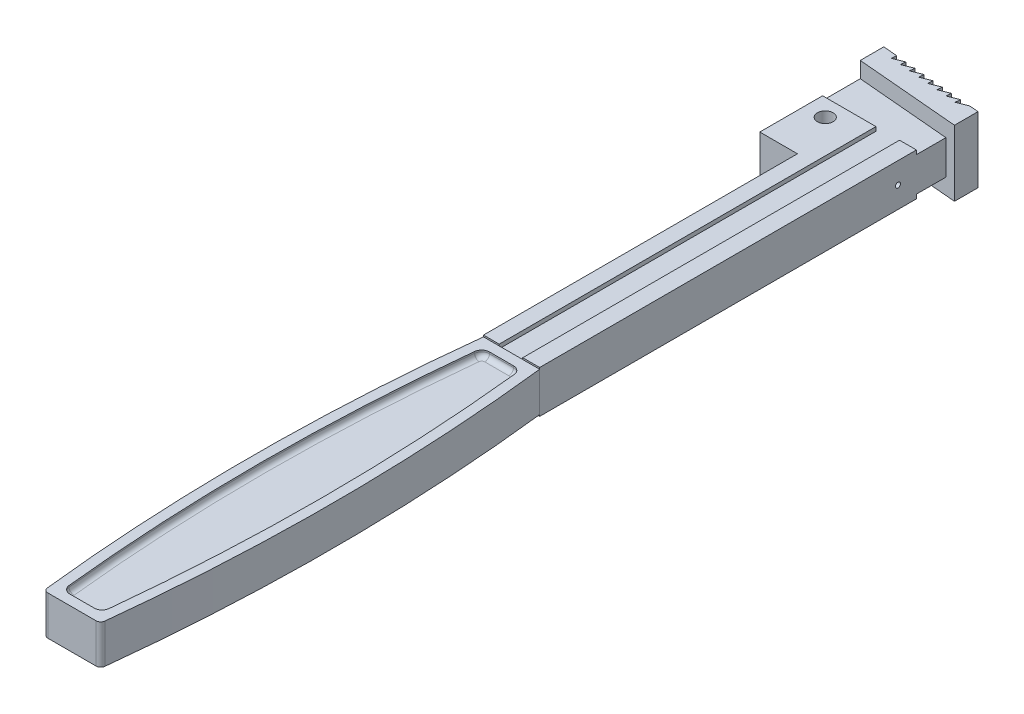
ISO-10303-21;
HEADER;
FILE_DESCRIPTION(('STEP AP214'),'2;1');
FILE_NAME('part.step','',(''),(''),'','','');
FILE_SCHEMA(('AUTOMOTIVE_DESIGN { 1 0 10303 214 1 1 1 1 }'));
ENDSEC;
DATA;
#1=APPLICATION_CONTEXT('core data for automotive mechanical design processes');
#2=APPLICATION_PROTOCOL_DEFINITION('international standard','automotive_design',2000,#1);
#3=PRODUCT_CONTEXT('',#1,'mechanical');
#4=PRODUCT('Part','Part','',(#3));
#5=PRODUCT_RELATED_PRODUCT_CATEGORY('part','',(#4));
#6=PRODUCT_DEFINITION_FORMATION('','',#4);
#7=PRODUCT_DEFINITION_CONTEXT('part definition',#1,'design');
#8=PRODUCT_DEFINITION('design','',#6,#7);
#9=PRODUCT_DEFINITION_SHAPE('','',#8);
#10=(LENGTH_UNIT() NAMED_UNIT(*) SI_UNIT(.MILLI.,.METRE.));
#11=(NAMED_UNIT(*) PLANE_ANGLE_UNIT() SI_UNIT($,.RADIAN.));
#12=(NAMED_UNIT(*) SI_UNIT($,.STERADIAN.) SOLID_ANGLE_UNIT());
#13=UNCERTAINTY_MEASURE_WITH_UNIT(LENGTH_MEASURE(1.E-05),#10,'distance_accuracy_value','');
#14=(GEOMETRIC_REPRESENTATION_CONTEXT(3) GLOBAL_UNCERTAINTY_ASSIGNED_CONTEXT((#13)) GLOBAL_UNIT_ASSIGNED_CONTEXT((#10,
#11,#12)) REPRESENTATION_CONTEXT('',''));
#15=CARTESIAN_POINT('',(0.,0.,0.));
#16=DIRECTION('',(0.,0.,1.));
#17=DIRECTION('',(1.,0.,0.));
#18=AXIS2_PLACEMENT_3D('',#15,#16,#17);
#19=CARTESIAN_POINT('',(609.077029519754,-6.25,-69.7480148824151));
#20=DIRECTION('',(0.,1.,0.));
#21=DIRECTION('',(0.,0.,1.));
#22=AXIS2_PLACEMENT_3D('',#19,#20,#21);
#23=PLANE('',#22);
#24=CARTESIAN_POINT('',(-609.077029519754,-6.25,-69.7480148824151));
#25=DIRECTION('',(0.,1.,0.));
#26=DIRECTION('',(0.,0.,-1.));
#27=AXIS2_PLACEMENT_3D('',#24,#25,#26);
#28=CIRCLE('',#27,622.);
#29=CARTESIAN_POINT('',(9.14919259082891,-6.25,-1.33501688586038));
#30=VERTEX_POINT('',#29);
#31=CARTESIAN_POINT('',(8.94292047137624,-6.25,-140.));
#32=VERTEX_POINT('',#31);
#33=EDGE_CURVE('E1057',#30,#32,#28,.T.);
#34=ORIENTED_EDGE('',*,*,#33,.F.);
#35=CARTESIAN_POINT('',(7.65829334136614,-6.25,-1.5));
#36=DIRECTION('',(0.,1.,0.));
#37=DIRECTION('',(0.,0.,1.));
#38=AXIS2_PLACEMENT_3D('',#35,#36,#37);
#39=CIRCLE('',#38,1.5);
#40=CARTESIAN_POINT('',(7.65829334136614,-6.25,0.));
#41=VERTEX_POINT('',#40);
#42=EDGE_CURVE('E1028',#30,#41,#39,.F.);
#43=ORIENTED_EDGE('',*,*,#42,.T.);
#44=DIRECTION('',(1.,0.,0.));
#45=VECTOR('',#44,1.);
#46=CARTESIAN_POINT('',(-9.,-6.25,0.));
#47=LINE('',#46,#45);
#48=CARTESIAN_POINT('',(-7.65829334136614,-6.25,0.));
#49=VERTEX_POINT('',#48);
#50=EDGE_CURVE('E1056',#49,#41,#47,.T.);
#51=ORIENTED_EDGE('',*,*,#50,.F.);
#52=CARTESIAN_POINT('',(-7.65829334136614,-6.25,-1.5));
#53=DIRECTION('',(0.,1.,0.));
#54=DIRECTION('',(0.,0.,1.));
#55=AXIS2_PLACEMENT_3D('',#52,#53,#54);
#56=CIRCLE('',#55,1.5);
#57=CARTESIAN_POINT('',(-9.14919259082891,-6.25,-1.33501688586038));
#58=VERTEX_POINT('',#57);
#59=EDGE_CURVE('E1026',#49,#58,#56,.F.);
#60=ORIENTED_EDGE('',*,*,#59,.T.);
#61=CARTESIAN_POINT('',(609.077029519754,-6.25,-69.7480148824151));
#62=DIRECTION('',(0.,1.,0.));
#63=DIRECTION('',(0.,0.,1.));
#64=AXIS2_PLACEMENT_3D('',#61,#62,#63);
#65=CIRCLE('',#64,622.);
#66=CARTESIAN_POINT('',(-8.94292047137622,-6.25,-140.));
#67=VERTEX_POINT('',#66);
#68=EDGE_CURVE('E1060',#67,#58,#65,.T.);
#69=ORIENTED_EDGE('',*,*,#68,.F.);
#70=DIRECTION('',(1.,0.,0.));
#71=VECTOR('',#70,1.);
#72=CARTESIAN_POINT('',(-8.94292047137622,-6.25,-140.));
#73=LINE('',#72,#71);
#74=CARTESIAN_POINT('',(-3.94292047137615,-6.25,-140.));
#75=VERTEX_POINT('',#74);
#76=EDGE_CURVE('E530',#67,#75,#73,.T.);
#77=ORIENTED_EDGE('',*,*,#76,.T.);
#78=DIRECTION('',(1.,0.,0.));
#79=VECTOR('',#78,1.);
#80=CARTESIAN_POINT('',(-3.94292047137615,-6.25,-140.));
#81=LINE('',#80,#79);
#82=CARTESIAN_POINT('',(3.55707952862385,-6.25,-140.));
#83=VERTEX_POINT('',#82);
#84=EDGE_CURVE('E586',#75,#83,#81,.T.);
#85=ORIENTED_EDGE('',*,*,#84,.T.);
#86=DIRECTION('',(1.,0.,0.));
#87=VECTOR('',#86,1.);
#88=CARTESIAN_POINT('',(3.55707952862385,-6.25,-140.));
#89=LINE('',#88,#87);
#90=EDGE_CURVE('E553',#83,#32,#89,.T.);
#91=ORIENTED_EDGE('',*,*,#90,.T.);
#92=EDGE_LOOP('',(#34,#43,#51,#60,#69,#77,#85,#91));
#93=FACE_BOUND('',#92,.T.);
#94=DIRECTION('',(-1.,0.,0.));
#95=VECTOR('',#94,1.);
#96=CARTESIAN_POINT('',(-6.07943130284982,-6.25,-136.8));
#97=LINE('',#96,#95);
#98=CARTESIAN_POINT('',(3.83302197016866,-6.25,-136.8));
#99=VERTEX_POINT('',#98);
#100=CARTESIAN_POINT('',(-3.83302197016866,-6.25,-136.8));
#101=VERTEX_POINT('',#100);
#102=EDGE_CURVE('E577',#99,#101,#97,.T.);
#103=ORIENTED_EDGE('',*,*,#102,.T.);
#104=CARTESIAN_POINT('',(-3.83302197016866,-6.25,-134.3));
#105=DIRECTION('',(0.,1.,0.));
#106=DIRECTION('',(0.,0.,1.));
#107=AXIS2_PLACEMENT_3D('',#104,#105,#106);
#108=CIRCLE('',#107,2.5);
#109=CARTESIAN_POINT('',(-6.31927075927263,-6.25,-134.561852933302));
#110=VERTEX_POINT('',#109);
#111=EDGE_CURVE('E903',#101,#110,#108,.T.);
#112=ORIENTED_EDGE('',*,*,#111,.T.);
#113=CARTESIAN_POINT('',(609.077029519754,-6.25,-69.7480148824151));
#114=DIRECTION('',(0.,1.,0.));
#115=DIRECTION('',(0.,0.,1.));
#116=AXIS2_PLACEMENT_3D('',#113,#114,#115);
#117=CIRCLE('',#116,618.8);
#118=CARTESIAN_POINT('',(-6.37235413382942,-6.25,-5.44019140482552));
#119=VERTEX_POINT('',#118);
#120=EDGE_CURVE('E574',#110,#119,#117,.T.);
#121=ORIENTED_EDGE('',*,*,#120,.T.);
#122=CARTESIAN_POINT('',(-3.88589088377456,-6.25,-5.70000000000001));
#123=DIRECTION('',(0.,1.,0.));
#124=DIRECTION('',(0.,0.,1.));
#125=AXIS2_PLACEMENT_3D('',#122,#123,#124);
#126=CIRCLE('',#125,2.5);
#127=CARTESIAN_POINT('',(-3.88589088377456,-6.25,-3.20000000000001));
#128=VERTEX_POINT('',#127);
#129=EDGE_CURVE('E907',#119,#128,#126,.T.);
#130=ORIENTED_EDGE('',*,*,#129,.T.);
#131=DIRECTION('',(1.,0.,0.));
#132=VECTOR('',#131,1.);
#133=CARTESIAN_POINT('',(-6.13415512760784,-6.25,-3.20000000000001));
#134=LINE('',#133,#132);
#135=CARTESIAN_POINT('',(3.88589088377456,-6.25,-3.20000000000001));
#136=VERTEX_POINT('',#135);
#137=EDGE_CURVE('E583',#128,#136,#134,.T.);
#138=ORIENTED_EDGE('',*,*,#137,.T.);
#139=CARTESIAN_POINT('',(3.88589088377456,-6.25,-5.69999999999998));
#140=DIRECTION('',(0.,1.,0.));
#141=DIRECTION('',(0.,0.,1.));
#142=AXIS2_PLACEMENT_3D('',#139,#140,#141);
#143=CIRCLE('',#142,2.5);
#144=CARTESIAN_POINT('',(6.37235413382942,-6.25,-5.44019140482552));
#145=VERTEX_POINT('',#144);
#146=EDGE_CURVE('E905',#136,#145,#143,.T.);
#147=ORIENTED_EDGE('',*,*,#146,.T.);
#148=CARTESIAN_POINT('',(-609.077029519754,-6.25,-69.7480148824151));
#149=DIRECTION('',(0.,1.,0.));
#150=DIRECTION('',(0.,0.,1.));
#151=AXIS2_PLACEMENT_3D('',#148,#149,#150);
#152=CIRCLE('',#151,618.8);
#153=CARTESIAN_POINT('',(6.31927075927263,-6.25,-134.561852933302));
#154=VERTEX_POINT('',#153);
#155=EDGE_CURVE('E580',#145,#154,#152,.T.);
#156=ORIENTED_EDGE('',*,*,#155,.T.);
#157=CARTESIAN_POINT('',(3.83302197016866,-6.25,-134.3));
#158=DIRECTION('',(0.,1.,0.));
#159=DIRECTION('',(0.,0.,1.));
#160=AXIS2_PLACEMENT_3D('',#157,#158,#159);
#161=CIRCLE('',#160,2.5);
#162=EDGE_CURVE('E909',#154,#99,#161,.T.);
#163=ORIENTED_EDGE('',*,*,#162,.T.);
#164=EDGE_LOOP('',(#103,#112,#121,#130,#138,#147,#156,#163));
#165=FACE_BOUND('',#164,.T.);
#166=ADVANCED_FACE('F50',(#93,#165),#23,.F.);
#167=CARTESIAN_POINT('',(-20.9429204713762,-5.45,-260.));
#168=DIRECTION('',(0.,0.,-1.));
#169=DIRECTION('',(-1.,0.,0.));
#170=AXIS2_PLACEMENT_3D('',#167,#168,#169);
#171=PLANE('',#170);
#172=DIRECTION('',(1.,0.,0.));
#173=VECTOR('',#172,1.);
#174=CARTESIAN_POINT('',(-20.9429204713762,-5.45,-260.));
#175=LINE('',#174,#173);
#176=CARTESIAN_POINT('',(-20.9429204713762,-5.45,-260.));
#177=VERTEX_POINT('',#176);
#178=CARTESIAN_POINT('',(-3.94292047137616,-5.45,-260.));
#179=VERTEX_POINT('',#178);
#180=EDGE_CURVE('E608',#177,#179,#175,.T.);
#181=ORIENTED_EDGE('',*,*,#180,.T.);
#182=DIRECTION('',(0.,-1.,0.));
#183=VECTOR('',#182,1.);
#184=CARTESIAN_POINT('',(-3.94292047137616,-5.45,-260.));
#185=LINE('',#184,#183);
#186=CARTESIAN_POINT('',(-3.94292047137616,-6.75,-260.));
#187=VERTEX_POINT('',#186);
#188=EDGE_CURVE('E596',#179,#187,#185,.T.);
#189=ORIENTED_EDGE('',*,*,#188,.T.);
#190=DIRECTION('',(-1.,0.,0.));
#191=VECTOR('',#190,1.);
#192=CARTESIAN_POINT('',(-3.94292047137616,-6.75,-260.));
#193=LINE('',#192,#191);
#194=CARTESIAN_POINT('',(-20.9429204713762,-6.75,-260.));
#195=VERTEX_POINT('',#194);
#196=EDGE_CURVE('E542',#187,#195,#193,.T.);
#197=ORIENTED_EDGE('',*,*,#196,.T.);
#198=DIRECTION('',(0.,-1.,0.));
#199=VECTOR('',#198,1.);
#200=CARTESIAN_POINT('',(-20.9429204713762,-5.45,-260.));
#201=LINE('',#200,#199);
#202=EDGE_CURVE('E618',#177,#195,#201,.T.);
#203=ORIENTED_EDGE('',*,*,#202,.F.);
#204=EDGE_LOOP('',(#181,#189,#197,#203));
#205=FACE_BOUND('',#204,.T.);
#206=ADVANCED_FACE('F1226',(#205),#171,.T.);
#207=DIRECTION('',(0.,-1.,0.));
#208=VECTOR('',#207,1.);
#209=CARTESIAN_POINT('',(8.94292047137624,-5.45,-260.));
#210=LINE('',#209,#208);
#211=CARTESIAN_POINT('',(8.94292047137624,-5.45,-260.));
#212=VERTEX_POINT('',#211);
#213=CARTESIAN_POINT('',(8.94292047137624,-6.75,-260.));
#214=VERTEX_POINT('',#213);
#215=EDGE_CURVE('E617',#212,#214,#210,.T.);
#216=ORIENTED_EDGE('',*,*,#215,.T.);
#217=DIRECTION('',(-1.,0.,0.));
#218=VECTOR('',#217,1.);
#219=CARTESIAN_POINT('',(8.94292047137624,-6.75,-260.));
#220=LINE('',#219,#218);
#221=CARTESIAN_POINT('',(3.55707952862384,-6.75,-260.));
#222=VERTEX_POINT('',#221);
#223=EDGE_CURVE('E554',#214,#222,#220,.T.);
#224=ORIENTED_EDGE('',*,*,#223,.T.);
#225=DIRECTION('',(0.,-1.,0.));
#226=VECTOR('',#225,1.);
#227=CARTESIAN_POINT('',(3.55707952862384,-5.45,-260.));
#228=LINE('',#227,#226);
#229=CARTESIAN_POINT('',(3.55707952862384,-5.45,-260.));
#230=VERTEX_POINT('',#229);
#231=EDGE_CURVE('E593',#230,#222,#228,.T.);
#232=ORIENTED_EDGE('',*,*,#231,.F.);
#233=EDGE_CURVE('E607',#230,#212,#175,.T.);
#234=ORIENTED_EDGE('',*,*,#233,.T.);
#235=EDGE_LOOP('',(#216,#224,#232,#234));
#236=FACE_BOUND('',#235,.T.);
#237=ADVANCED_FACE('F1156',(#236),#171,.T.);
#238=CARTESIAN_POINT('',(8.94292047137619,6.25,-269.38532771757));
#239=DIRECTION('',(-1.,0.,0.));
#240=DIRECTION('',(0.,0.,1.));
#241=AXIS2_PLACEMENT_3D('',#238,#239,#240);
#242=PLANE('',#241);
#243=CARTESIAN_POINT('',(8.9429204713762,0.,-254.123860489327));
#244=DIRECTION('',(1.,0.,0.));
#245=DIRECTION('',(0.,0.,-1.));
#246=AXIS2_PLACEMENT_3D('',#243,#244,#245);
#247=CIRCLE('',#246,0.799999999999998);
#248=CARTESIAN_POINT('',(8.9429204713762,0.,-254.923860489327));
#249=VERTEX_POINT('',#248);
#250=EDGE_CURVE('E509',#249,#249,#247,.T.);
#251=ORIENTED_EDGE('',*,*,#250,.F.);
#252=EDGE_LOOP('',(#251));
#253=FACE_BOUND('',#252,.T.);
#254=ORIENTED_EDGE('',*,*,#215,.F.);
#255=DIRECTION('',(0.,0.,-1.));
#256=VECTOR('',#255,1.);
#257=CARTESIAN_POINT('',(8.94292047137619,-5.45,-269.38532771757));
#258=LINE('',#257,#256);
#259=CARTESIAN_POINT('',(8.94292047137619,-5.45,-269.38532771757));
#260=VERTEX_POINT('',#259);
#261=EDGE_CURVE('E598',#212,#260,#258,.T.);
#262=ORIENTED_EDGE('',*,*,#261,.T.);
#263=DIRECTION('',(0.,-1.,0.));
#264=VECTOR('',#263,1.);
#265=CARTESIAN_POINT('',(8.94292047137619,6.25,-269.38532771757));
#266=LINE('',#265,#264);
#267=CARTESIAN_POINT('',(8.94292047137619,5.45,-269.38532771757));
#268=VERTEX_POINT('',#267);
#269=EDGE_CURVE('E1072',#268,#260,#266,.T.);
#270=ORIENTED_EDGE('',*,*,#269,.F.);
#271=DIRECTION('',(0.,0.,-1.));
#272=VECTOR('',#271,1.);
#273=CARTESIAN_POINT('',(8.94292047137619,5.45,-269.38532771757));
#274=LINE('',#273,#272);
#275=CARTESIAN_POINT('',(8.94292047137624,5.45,-260.));
#276=VERTEX_POINT('',#275);
#277=EDGE_CURVE('E688',#276,#268,#274,.T.);
#278=ORIENTED_EDGE('',*,*,#277,.F.);
#279=DIRECTION('',(0.,1.,0.));
#280=VECTOR('',#279,1.);
#281=CARTESIAN_POINT('',(8.94292047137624,5.45,-260.));
#282=LINE('',#281,#280);
#283=CARTESIAN_POINT('',(8.94292047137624,6.75,-260.));
#284=VERTEX_POINT('',#283);
#285=EDGE_CURVE('E708',#276,#284,#282,.T.);
#286=ORIENTED_EDGE('',*,*,#285,.T.);
#287=DIRECTION('',(0.,0.,-1.));
#288=VECTOR('',#287,1.);
#289=CARTESIAN_POINT('',(8.94292047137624,6.75,-140.));
#290=LINE('',#289,#288);
#291=CARTESIAN_POINT('',(8.94292047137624,6.75,-140.));
#292=VERTEX_POINT('',#291);
#293=EDGE_CURVE('E652',#292,#284,#290,.T.);
#294=ORIENTED_EDGE('',*,*,#293,.F.);
#295=DIRECTION('',(0.,-1.,0.));
#296=VECTOR('',#295,1.);
#297=CARTESIAN_POINT('',(8.94292047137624,6.75,-140.));
#298=LINE('',#297,#296);
#299=CARTESIAN_POINT('',(8.94292047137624,6.25,-140.));
#300=VERTEX_POINT('',#299);
#301=EDGE_CURVE('E655',#292,#300,#298,.T.);
#302=ORIENTED_EDGE('',*,*,#301,.T.);
#303=DIRECTION('',(0.,-1.,0.));
#304=VECTOR('',#303,1.);
#305=CARTESIAN_POINT('',(8.94292047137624,6.25,-140.));
#306=LINE('',#305,#304);
#307=EDGE_CURVE('E1049',#300,#32,#306,.T.);
#308=ORIENTED_EDGE('',*,*,#307,.T.);
#309=DIRECTION('',(0.,1.,0.));
#310=VECTOR('',#309,1.);
#311=CARTESIAN_POINT('',(8.94292047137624,-6.75,-140.));
#312=LINE('',#311,#310);
#313=CARTESIAN_POINT('',(8.94292047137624,-6.75,-140.));
#314=VERTEX_POINT('',#313);
#315=EDGE_CURVE('E571',#314,#32,#312,.T.);
#316=ORIENTED_EDGE('',*,*,#315,.F.);
#317=DIRECTION('',(0.,0.,-1.));
#318=VECTOR('',#317,1.);
#319=CARTESIAN_POINT('',(8.94292047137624,-6.75,-140.));
#320=LINE('',#319,#318);
#321=EDGE_CURVE('E557',#314,#214,#320,.T.);
#322=ORIENTED_EDGE('',*,*,#321,.T.);
#323=EDGE_LOOP('',(#254,#262,#270,#278,#286,#294,#302,#308,#316,#322));
#324=FACE_BOUND('',#323,.T.);
#325=ADVANCED_FACE('F1150',(#253,#324),#242,.F.);
#326=CARTESIAN_POINT('',(-20.9429204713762,6.25,-240.));
#327=DIRECTION('',(1.,0.,0.));
#328=DIRECTION('',(0.,0.,-1.));
#329=AXIS2_PLACEMENT_3D('',#326,#327,#328);
#330=PLANE('',#329);
#331=DIRECTION('',(0.,-1.,0.));
#332=VECTOR('',#331,1.);
#333=CARTESIAN_POINT('',(-20.9429204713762,10.5,-272.));
#334=LINE('',#333,#332);
#335=CARTESIAN_POINT('',(-20.9429204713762,-5.45,-272.));
#336=VERTEX_POINT('',#335);
#337=CARTESIAN_POINT('',(-20.9429204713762,-10.5,-272.));
#338=VERTEX_POINT('',#337);
#339=EDGE_CURVE('E1110',#336,#338,#334,.T.);
#340=ORIENTED_EDGE('',*,*,#339,.F.);
#341=DIRECTION('',(0.,0.,1.));
#342=VECTOR('',#341,1.);
#343=CARTESIAN_POINT('',(-20.9429204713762,-5.45,-272.));
#344=LINE('',#343,#342);
#345=EDGE_CURVE('E611',#336,#177,#344,.T.);
#346=ORIENTED_EDGE('',*,*,#345,.T.);
#347=ORIENTED_EDGE('',*,*,#202,.T.);
#348=DIRECTION('',(0.,0.,1.));
#349=VECTOR('',#348,1.);
#350=CARTESIAN_POINT('',(-20.9429204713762,-6.75,-260.));
#351=LINE('',#350,#349);
#352=CARTESIAN_POINT('',(-20.9429204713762,-6.75,-240.));
#353=VERTEX_POINT('',#352);
#354=EDGE_CURVE('E539',#195,#353,#351,.T.);
#355=ORIENTED_EDGE('',*,*,#354,.T.);
#356=DIRECTION('',(0.,-1.,0.));
#357=VECTOR('',#356,1.);
#358=CARTESIAN_POINT('',(-20.9429204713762,6.25,-240.));
#359=LINE('',#358,#357);
#360=CARTESIAN_POINT('',(-20.9429204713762,6.75,-240.));
#361=VERTEX_POINT('',#360);
#362=EDGE_CURVE('E1070',#361,#353,#359,.T.);
#363=ORIENTED_EDGE('',*,*,#362,.F.);
#364=DIRECTION('',(0.,0.,1.));
#365=VECTOR('',#364,1.);
#366=CARTESIAN_POINT('',(-20.9429204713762,6.75,-260.));
#367=LINE('',#366,#365);
#368=CARTESIAN_POINT('',(-20.9429204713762,6.75,-260.));
#369=VERTEX_POINT('',#368);
#370=EDGE_CURVE('E628',#369,#361,#367,.T.);
#371=ORIENTED_EDGE('',*,*,#370,.F.);
#372=DIRECTION('',(0.,1.,0.));
#373=VECTOR('',#372,1.);
#374=CARTESIAN_POINT('',(-20.9429204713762,5.45,-260.));
#375=LINE('',#374,#373);
#376=CARTESIAN_POINT('',(-20.9429204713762,5.45,-260.));
#377=VERTEX_POINT('',#376);
#378=EDGE_CURVE('E707',#377,#369,#375,.T.);
#379=ORIENTED_EDGE('',*,*,#378,.F.);
#380=DIRECTION('',(0.,0.,1.));
#381=VECTOR('',#380,1.);
#382=CARTESIAN_POINT('',(-20.9429204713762,5.45,-272.));
#383=LINE('',#382,#381);
#384=CARTESIAN_POINT('',(-20.9429204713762,5.45,-272.));
#385=VERTEX_POINT('',#384);
#386=EDGE_CURVE('E701',#385,#377,#383,.T.);
#387=ORIENTED_EDGE('',*,*,#386,.F.);
#388=CARTESIAN_POINT('',(-20.9429204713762,10.5,-272.));
#389=VERTEX_POINT('',#388);
#390=EDGE_CURVE('E1064',#389,#385,#334,.T.);
#391=ORIENTED_EDGE('',*,*,#390,.F.);
#392=DIRECTION('',(0.,0.,1.));
#393=VECTOR('',#392,1.);
#394=CARTESIAN_POINT('',(-20.9429204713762,10.5,-272.));
#395=LINE('',#394,#393);
#396=CARTESIAN_POINT('',(-20.9429204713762,10.5,-279.5));
#397=VERTEX_POINT('',#396);
#398=EDGE_CURVE('E812',#397,#389,#395,.T.);
#399=ORIENTED_EDGE('',*,*,#398,.F.);
#400=DIRECTION('',(0.,-1.,0.));
#401=VECTOR('',#400,1.);
#402=CARTESIAN_POINT('',(-20.9429204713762,10.5,-279.5));
#403=LINE('',#402,#401);
#404=CARTESIAN_POINT('',(-20.9429204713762,-10.5,-279.5));
#405=VERTEX_POINT('',#404);
#406=EDGE_CURVE('E824',#397,#405,#403,.T.);
#407=ORIENTED_EDGE('',*,*,#406,.T.);
#408=DIRECTION('',(0.,0.,1.));
#409=VECTOR('',#408,1.);
#410=CARTESIAN_POINT('',(-20.9429204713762,-10.5,-272.));
#411=LINE('',#410,#409);
#412=EDGE_CURVE('E809',#405,#338,#411,.T.);
#413=ORIENTED_EDGE('',*,*,#412,.T.);
#414=EDGE_LOOP('',(#340,#346,#347,#355,#363,#371,#379,#387,#391,#399,#407,#413));
#415=FACE_BOUND('',#414,.T.);
#416=ADVANCED_FACE('F1100',(#415),#330,.F.);
#417=CARTESIAN_POINT('',(609.077029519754,6.25,-69.7480148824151));
#418=DIRECTION('',(0.,1.,0.));
#419=DIRECTION('',(0.,0.,1.));
#420=AXIS2_PLACEMENT_3D('',#417,#418,#419);
#421=PLANE('',#420);
#422=CARTESIAN_POINT('',(609.077029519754,6.25,-69.7480148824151));
#423=DIRECTION('',(0.,1.,0.));
#424=DIRECTION('',(0.,0.,1.));
#425=AXIS2_PLACEMENT_3D('',#422,#423,#424);
#426=CIRCLE('',#425,618.8);
#427=CARTESIAN_POINT('',(-6.31927075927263,6.25,-134.561852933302));
#428=VERTEX_POINT('',#427);
#429=CARTESIAN_POINT('',(-6.37235413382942,6.25,-5.44019140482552));
#430=VERTEX_POINT('',#429);
#431=EDGE_CURVE('E662',#428,#430,#426,.T.);
#432=ORIENTED_EDGE('',*,*,#431,.F.);
#433=CARTESIAN_POINT('',(-3.83302197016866,6.25,-134.3));
#434=DIRECTION('',(0.,1.,0.));
#435=DIRECTION('',(0.,0.,1.));
#436=AXIS2_PLACEMENT_3D('',#433,#434,#435);
#437=CIRCLE('',#436,2.5);
#438=CARTESIAN_POINT('',(-3.83302197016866,6.25,-136.8));
#439=VERTEX_POINT('',#438);
#440=EDGE_CURVE('E881',#428,#439,#437,.F.);
#441=ORIENTED_EDGE('',*,*,#440,.T.);
#442=DIRECTION('',(-1.,0.,0.));
#443=VECTOR('',#442,1.);
#444=CARTESIAN_POINT('',(-6.07943130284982,6.25,-136.8));
#445=LINE('',#444,#443);
#446=CARTESIAN_POINT('',(3.83302197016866,6.25,-136.8));
#447=VERTEX_POINT('',#446);
#448=EDGE_CURVE('E671',#447,#439,#445,.T.);
#449=ORIENTED_EDGE('',*,*,#448,.F.);
#450=CARTESIAN_POINT('',(3.83302197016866,6.25,-134.3));
#451=DIRECTION('',(0.,1.,0.));
#452=DIRECTION('',(0.,0.,1.));
#453=AXIS2_PLACEMENT_3D('',#450,#451,#452);
#454=CIRCLE('',#453,2.5);
#455=CARTESIAN_POINT('',(6.31927075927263,6.25,-134.561852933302));
#456=VERTEX_POINT('',#455);
#457=EDGE_CURVE('E877',#447,#456,#454,.F.);
#458=ORIENTED_EDGE('',*,*,#457,.T.);
#459=CARTESIAN_POINT('',(-609.077029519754,6.25,-69.7480148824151));
#460=DIRECTION('',(0.,1.,0.));
#461=DIRECTION('',(0.,0.,1.));
#462=AXIS2_PLACEMENT_3D('',#459,#460,#461);
#463=CIRCLE('',#462,618.8);
#464=CARTESIAN_POINT('',(6.37235413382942,6.25,-5.44019140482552));
#465=VERTEX_POINT('',#464);
#466=EDGE_CURVE('E668',#465,#456,#463,.T.);
#467=ORIENTED_EDGE('',*,*,#466,.F.);
#468=CARTESIAN_POINT('',(3.88589088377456,6.25,-5.69999999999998));
#469=DIRECTION('',(0.,1.,0.));
#470=DIRECTION('',(0.,0.,1.));
#471=AXIS2_PLACEMENT_3D('',#468,#469,#470);
#472=CIRCLE('',#471,2.5);
#473=CARTESIAN_POINT('',(3.88589088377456,6.25,-3.20000000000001));
#474=VERTEX_POINT('',#473);
#475=EDGE_CURVE('E875',#465,#474,#472,.F.);
#476=ORIENTED_EDGE('',*,*,#475,.T.);
#477=DIRECTION('',(1.,0.,0.));
#478=VECTOR('',#477,1.);
#479=CARTESIAN_POINT('',(-6.13415512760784,6.25,-3.20000000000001));
#480=LINE('',#479,#478);
#481=CARTESIAN_POINT('',(-3.88589088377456,6.25,-3.20000000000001));
#482=VERTEX_POINT('',#481);
#483=EDGE_CURVE('E665',#482,#474,#480,.T.);
#484=ORIENTED_EDGE('',*,*,#483,.F.);
#485=CARTESIAN_POINT('',(-3.88589088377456,6.25,-5.70000000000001));
#486=DIRECTION('',(0.,1.,0.));
#487=DIRECTION('',(0.,0.,1.));
#488=AXIS2_PLACEMENT_3D('',#485,#486,#487);
#489=CIRCLE('',#488,2.5);
#490=EDGE_CURVE('E879',#482,#430,#489,.F.);
#491=ORIENTED_EDGE('',*,*,#490,.T.);
#492=EDGE_LOOP('',(#432,#441,#449,#458,#467,#476,#484,#491));
#493=FACE_BOUND('',#492,.T.);
#494=DIRECTION('',(1.,0.,0.));
#495=VECTOR('',#494,1.);
#496=CARTESIAN_POINT('',(-9.,6.25,0.));
#497=LINE('',#496,#495);
#498=CARTESIAN_POINT('',(-7.65829334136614,6.25,0.));
#499=VERTEX_POINT('',#498);
#500=CARTESIAN_POINT('',(7.65829334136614,6.25,0.));
#501=VERTEX_POINT('',#500);
#502=EDGE_CURVE('E1041',#499,#501,#497,.T.);
#503=ORIENTED_EDGE('',*,*,#502,.T.);
#504=CARTESIAN_POINT('',(7.65829334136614,6.25,-1.5));
#505=DIRECTION('',(0.,1.,0.));
#506=DIRECTION('',(0.,0.,1.));
#507=AXIS2_PLACEMENT_3D('',#504,#505,#506);
#508=CIRCLE('',#507,1.5);
#509=CARTESIAN_POINT('',(9.14919259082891,6.25,-1.33501688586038));
#510=VERTEX_POINT('',#509);
#511=EDGE_CURVE('E58',#501,#510,#508,.T.);
#512=ORIENTED_EDGE('',*,*,#511,.T.);
#513=CARTESIAN_POINT('',(-609.077029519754,6.25,-69.7480148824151));
#514=DIRECTION('',(0.,1.,0.));
#515=DIRECTION('',(0.,0.,-1.));
#516=AXIS2_PLACEMENT_3D('',#513,#514,#515);
#517=CIRCLE('',#516,622.);
#518=EDGE_CURVE('E1040',#510,#300,#517,.T.);
#519=ORIENTED_EDGE('',*,*,#518,.T.);
#520=DIRECTION('',(1.,0.,0.));
#521=VECTOR('',#520,1.);
#522=CARTESIAN_POINT('',(3.55707952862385,6.25,-140.));
#523=LINE('',#522,#521);
#524=CARTESIAN_POINT('',(3.55707952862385,6.25,-140.));
#525=VERTEX_POINT('',#524);
#526=EDGE_CURVE('E644',#525,#300,#523,.T.);
#527=ORIENTED_EDGE('',*,*,#526,.F.);
#528=DIRECTION('',(1.,0.,0.));
#529=VECTOR('',#528,1.);
#530=CARTESIAN_POINT('',(-3.94292047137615,6.25,-140.));
#531=LINE('',#530,#529);
#532=CARTESIAN_POINT('',(-3.94292047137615,6.25,-140.));
#533=VERTEX_POINT('',#532);
#534=EDGE_CURVE('E674',#533,#525,#531,.T.);
#535=ORIENTED_EDGE('',*,*,#534,.F.);
#536=DIRECTION('',(1.,0.,0.));
#537=VECTOR('',#536,1.);
#538=CARTESIAN_POINT('',(-8.94292047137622,6.25,-140.));
#539=LINE('',#538,#537);
#540=CARTESIAN_POINT('',(-8.94292047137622,6.25,-140.));
#541=VERTEX_POINT('',#540);
#542=EDGE_CURVE('E620',#541,#533,#539,.T.);
#543=ORIENTED_EDGE('',*,*,#542,.F.);
#544=CARTESIAN_POINT('',(609.077029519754,6.25,-69.7480148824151));
#545=DIRECTION('',(0.,1.,0.));
#546=DIRECTION('',(0.,0.,1.));
#547=AXIS2_PLACEMENT_3D('',#544,#545,#546);
#548=CIRCLE('',#547,622.);
#549=CARTESIAN_POINT('',(-9.14919259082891,6.25,-1.33501688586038));
#550=VERTEX_POINT('',#549);
#551=EDGE_CURVE('E1062',#541,#550,#548,.T.);
#552=ORIENTED_EDGE('',*,*,#551,.T.);
#553=CARTESIAN_POINT('',(-7.65829334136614,6.25,-1.5));
#554=DIRECTION('',(0.,1.,0.));
#555=DIRECTION('',(0.,0.,1.));
#556=AXIS2_PLACEMENT_3D('',#553,#554,#555);
#557=CIRCLE('',#556,1.5);
#558=EDGE_CURVE('E1034',#550,#499,#557,.T.);
#559=ORIENTED_EDGE('',*,*,#558,.T.);
#560=EDGE_LOOP('',(#503,#512,#519,#527,#535,#543,#552,#559));
#561=FACE_BOUND('',#560,.T.);
#562=ADVANCED_FACE('F1038',(#493,#561),#421,.T.);
#563=CARTESIAN_POINT('',(-20.9429204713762,5.45,-260.));
#564=DIRECTION('',(0.,0.,1.));
#565=DIRECTION('',(1.,0.,0.));
#566=AXIS2_PLACEMENT_3D('',#563,#564,#565);
#567=PLANE('',#566);
#568=DIRECTION('',(1.,0.,0.));
#569=VECTOR('',#568,1.);
#570=CARTESIAN_POINT('',(-20.9429204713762,5.45,-260.));
#571=LINE('',#570,#569);
#572=CARTESIAN_POINT('',(3.55707952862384,5.45,-260.));
#573=VERTEX_POINT('',#572);
#574=EDGE_CURVE('E703',#573,#276,#571,.T.);
#575=ORIENTED_EDGE('',*,*,#574,.F.);
#576=DIRECTION('',(0.,1.,0.));
#577=VECTOR('',#576,1.);
#578=CARTESIAN_POINT('',(3.55707952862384,5.45,-260.));
#579=LINE('',#578,#577);
#580=CARTESIAN_POINT('',(3.55707952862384,6.75,-260.));
#581=VERTEX_POINT('',#580);
#582=EDGE_CURVE('E686',#573,#581,#579,.T.);
#583=ORIENTED_EDGE('',*,*,#582,.T.);
#584=DIRECTION('',(-1.,0.,0.));
#585=VECTOR('',#584,1.);
#586=CARTESIAN_POINT('',(8.94292047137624,6.75,-260.));
#587=LINE('',#586,#585);
#588=EDGE_CURVE('E645',#284,#581,#587,.T.);
#589=ORIENTED_EDGE('',*,*,#588,.F.);
#590=ORIENTED_EDGE('',*,*,#285,.F.);
#591=EDGE_LOOP('',(#575,#583,#589,#590));
#592=FACE_BOUND('',#591,.T.);
#593=ADVANCED_FACE('F1177',(#592),#567,.F.);
#594=CARTESIAN_POINT('',(-20.9429204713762,10.5,-279.5));
#595=DIRECTION('',(-0.0871557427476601,0.,0.996194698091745));
#596=DIRECTION('',(0.996194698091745,0.,0.0871557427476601));
#597=AXIS2_PLACEMENT_3D('',#594,#595,#596);
#598=PLANE('',#597);
#599=DIRECTION('',(-0.996194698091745,0.,-0.08715574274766));
#600=VECTOR('',#599,1.);
#601=CARTESIAN_POINT('',(-20.9429204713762,-10.5,-279.5));
#602=LINE('',#601,#600);
#603=CARTESIAN_POINT('',(11.9315045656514,-10.5,-276.623860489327));
#604=VERTEX_POINT('',#603);
#605=CARTESIAN_POINT('',(9.04253994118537,-10.5,-276.876612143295));
#606=VERTEX_POINT('',#605);
#607=EDGE_CURVE('E816',#604,#606,#602,.T.);
#608=ORIENTED_EDGE('',*,*,#607,.T.);
#609=DIRECTION('',(0.,1.,0.));
#610=VECTOR('',#609,1.);
#611=CARTESIAN_POINT('',(9.04253994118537,-10.50014,-276.876612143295));
#612=LINE('',#611,#610);
#613=CARTESIAN_POINT('',(9.04253994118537,10.5,-276.876612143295));
#614=VERTEX_POINT('',#613);
#615=EDGE_CURVE('E710',#606,#614,#612,.T.);
#616=ORIENTED_EDGE('',*,*,#615,.T.);
#617=DIRECTION('',(-0.996194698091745,0.,-0.08715574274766));
#618=VECTOR('',#617,1.);
#619=CARTESIAN_POINT('',(-20.9429204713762,10.5,-279.5));
#620=LINE('',#619,#618);
#621=CARTESIAN_POINT('',(11.9315045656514,10.5,-276.623860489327));
#622=VERTEX_POINT('',#621);
#623=EDGE_CURVE('E821',#622,#614,#620,.T.);
#624=ORIENTED_EDGE('',*,*,#623,.F.);
#625=DIRECTION('',(0.,-1.,0.));
#626=VECTOR('',#625,1.);
#627=CARTESIAN_POINT('',(11.9315045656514,10.5,-276.623860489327));
#628=LINE('',#627,#626);
#629=EDGE_CURVE('E1102',#622,#604,#628,.T.);
#630=ORIENTED_EDGE('',*,*,#629,.T.);
#631=EDGE_LOOP('',(#608,#616,#624,#630));
#632=FACE_BOUND('',#631,.T.);
#633=ADVANCED_FACE('F1224',(#632),#598,.F.);
#634=CARTESIAN_POINT('',(609.077029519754,6.25,-69.7480148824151));
#635=DIRECTION('',(0.,-1.,0.));
#636=DIRECTION('',(0.,0.,-1.));
#637=AXIS2_PLACEMENT_3D('',#634,#635,#636);
#638=CYLINDRICAL_SURFACE('',#637,622.);
#639=ORIENTED_EDGE('',*,*,#68,.T.);
#640=DIRECTION('',(0.,-1.,0.));
#641=VECTOR('',#640,1.);
#642=CARTESIAN_POINT('',(-9.14919259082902,6.25,-1.33501688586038));
#643=LINE('',#642,#641);
#644=EDGE_CURVE('E13',#58,#550,#643,.F.);
#645=ORIENTED_EDGE('',*,*,#644,.T.);
#646=ORIENTED_EDGE('',*,*,#551,.F.);
#647=DIRECTION('',(0.,-1.,0.));
#648=VECTOR('',#647,1.);
#649=CARTESIAN_POINT('',(-8.94292047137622,6.25,-140.));
#650=LINE('',#649,#648);
#651=EDGE_CURVE('E1050',#541,#67,#650,.T.);
#652=ORIENTED_EDGE('',*,*,#651,.T.);
#653=EDGE_LOOP('',(#639,#645,#646,#652));
#654=FACE_BOUND('',#653,.T.);
#655=ADVANCED_FACE('F1125',(#654),#638,.T.);
#656=CARTESIAN_POINT('',(-9.,6.25,0.));
#657=DIRECTION('',(0.,0.,-1.));
#658=DIRECTION('',(-1.,0.,0.));
#659=AXIS2_PLACEMENT_3D('',#656,#657,#658);
#660=PLANE('',#659);
#661=ORIENTED_EDGE('',*,*,#50,.T.);
#662=DIRECTION('',(0.,-1.,0.));
#663=VECTOR('',#662,1.);
#664=CARTESIAN_POINT('',(7.65829334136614,6.25,0.));
#665=LINE('',#664,#663);
#666=EDGE_CURVE('E71',#41,#501,#665,.F.);
#667=ORIENTED_EDGE('',*,*,#666,.T.);
#668=ORIENTED_EDGE('',*,*,#502,.F.);
#669=DIRECTION('',(0.,-1.,0.));
#670=VECTOR('',#669,1.);
#671=CARTESIAN_POINT('',(-7.65829334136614,6.25,0.));
#672=LINE('',#671,#670);
#673=EDGE_CURVE('E1030',#499,#49,#672,.T.);
#674=ORIENTED_EDGE('',*,*,#673,.T.);
#675=EDGE_LOOP('',(#661,#667,#668,#674));
#676=FACE_BOUND('',#675,.T.);
#677=ADVANCED_FACE('F1058',(#676),#660,.F.);
#678=CARTESIAN_POINT('',(-609.077029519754,6.25,-69.7480148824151));
#679=DIRECTION('',(0.,-1.,0.));
#680=DIRECTION('',(0.,0.,-1.));
#681=AXIS2_PLACEMENT_3D('',#678,#679,#680);
#682=CYLINDRICAL_SURFACE('',#681,622.);
#683=ORIENTED_EDGE('',*,*,#518,.F.);
#684=DIRECTION('',(0.,-1.,0.));
#685=VECTOR('',#684,1.);
#686=CARTESIAN_POINT('',(9.14919259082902,6.25,-1.33501688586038));
#687=LINE('',#686,#685);
#688=EDGE_CURVE('E981',#510,#30,#687,.T.);
#689=ORIENTED_EDGE('',*,*,#688,.T.);
#690=ORIENTED_EDGE('',*,*,#33,.T.);
#691=ORIENTED_EDGE('',*,*,#307,.F.);
#692=EDGE_LOOP('',(#683,#689,#690,#691));
#693=FACE_BOUND('',#692,.T.);
#694=ADVANCED_FACE('F1046',(#693),#682,.T.);
#695=CARTESIAN_POINT('',(-8.94292047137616,6.25,-240.));
#696=DIRECTION('',(0.,0.,-1.));
#697=DIRECTION('',(-1.,0.,0.));
#698=AXIS2_PLACEMENT_3D('',#695,#696,#697);
#699=PLANE('',#698);
#700=ORIENTED_EDGE('',*,*,#362,.T.);
#701=DIRECTION('',(1.,0.,0.));
#702=VECTOR('',#701,1.);
#703=CARTESIAN_POINT('',(-20.9429204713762,-6.75,-240.));
#704=LINE('',#703,#702);
#705=CARTESIAN_POINT('',(-8.94292047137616,-6.75,-240.));
#706=VERTEX_POINT('',#705);
#707=EDGE_CURVE('E536',#353,#706,#704,.T.);
#708=ORIENTED_EDGE('',*,*,#707,.T.);
#709=DIRECTION('',(0.,-1.,0.));
#710=VECTOR('',#709,1.);
#711=CARTESIAN_POINT('',(-8.94292047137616,6.25,-240.));
#712=LINE('',#711,#710);
#713=CARTESIAN_POINT('',(-8.94292047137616,6.75,-240.));
#714=VERTEX_POINT('',#713);
#715=EDGE_CURVE('E1068',#714,#706,#712,.T.);
#716=ORIENTED_EDGE('',*,*,#715,.F.);
#717=DIRECTION('',(1.,0.,0.));
#718=VECTOR('',#717,1.);
#719=CARTESIAN_POINT('',(-20.9429204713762,6.75,-240.));
#720=LINE('',#719,#718);
#721=EDGE_CURVE('E631',#361,#714,#720,.T.);
#722=ORIENTED_EDGE('',*,*,#721,.F.);
#723=EDGE_LOOP('',(#700,#708,#716,#722));
#724=FACE_BOUND('',#723,.T.);
#725=ADVANCED_FACE('F1205',(#724),#699,.F.);
#726=CARTESIAN_POINT('',(-8.94292047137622,6.25,-140.));
#727=DIRECTION('',(1.,0.,0.));
#728=DIRECTION('',(0.,0.,-1.));
#729=AXIS2_PLACEMENT_3D('',#726,#727,#728);
#730=PLANE('',#729);
#731=CARTESIAN_POINT('',(-8.94292047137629,0.,-175.));
#732=DIRECTION('',(-1.,0.,0.));
#733=DIRECTION('',(0.,0.,1.));
#734=AXIS2_PLACEMENT_3D('',#731,#732,#733);
#735=CIRCLE('',#734,0.79999999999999);
#736=CARTESIAN_POINT('',(-8.94292047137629,0.,-174.2));
#737=VERTEX_POINT('',#736);
#738=EDGE_CURVE('E510',#737,#737,#735,.T.);
#739=ORIENTED_EDGE('',*,*,#738,.F.);
#740=EDGE_LOOP('',(#739));
#741=FACE_BOUND('',#740,.T.);
#742=ORIENTED_EDGE('',*,*,#715,.T.);
#743=DIRECTION('',(0.,0.,1.));
#744=VECTOR('',#743,1.);
#745=CARTESIAN_POINT('',(-8.94292047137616,-6.75,-240.));
#746=LINE('',#745,#744);
#747=CARTESIAN_POINT('',(-8.94292047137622,-6.75,-140.));
#748=VERTEX_POINT('',#747);
#749=EDGE_CURVE('E533',#706,#748,#746,.T.);
#750=ORIENTED_EDGE('',*,*,#749,.T.);
#751=DIRECTION('',(0.,1.,0.));
#752=VECTOR('',#751,1.);
#753=CARTESIAN_POINT('',(-8.94292047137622,-6.75,-140.));
#754=LINE('',#753,#752);
#755=EDGE_CURVE('E545',#748,#67,#754,.T.);
#756=ORIENTED_EDGE('',*,*,#755,.T.);
#757=ORIENTED_EDGE('',*,*,#651,.F.);
#758=DIRECTION('',(0.,-1.,0.));
#759=VECTOR('',#758,1.);
#760=CARTESIAN_POINT('',(-8.94292047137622,6.75,-140.));
#761=LINE('',#760,#759);
#762=CARTESIAN_POINT('',(-8.94292047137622,6.75,-140.));
#763=VERTEX_POINT('',#762);
#764=EDGE_CURVE('E642',#763,#541,#761,.T.);
#765=ORIENTED_EDGE('',*,*,#764,.F.);
#766=DIRECTION('',(0.,0.,1.));
#767=VECTOR('',#766,1.);
#768=CARTESIAN_POINT('',(-8.94292047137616,6.75,-240.));
#769=LINE('',#768,#767);
#770=EDGE_CURVE('E634',#714,#763,#769,.T.);
#771=ORIENTED_EDGE('',*,*,#770,.F.);
#772=EDGE_LOOP('',(#742,#750,#756,#757,#765,#771));
#773=FACE_BOUND('',#772,.T.);
#774=ADVANCED_FACE('F1128',(#741,#773),#730,.F.);
#775=CARTESIAN_POINT('',(-20.9429204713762,10.5,-272.));
#776=DIRECTION('',(0.0871557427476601,0.,-0.996194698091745));
#777=DIRECTION('',(-0.996194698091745,0.,-0.0871557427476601));
#778=AXIS2_PLACEMENT_3D('',#775,#776,#777);
#779=PLANE('',#778);
#780=DIRECTION('',(-0.996194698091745,0.,-0.0871557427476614));
#781=VECTOR('',#780,1.);
#782=CARTESIAN_POINT('',(-20.9429204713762,5.45,-272.));
#783=LINE('',#782,#781);
#784=EDGE_CURVE('E698',#268,#385,#783,.T.);
#785=ORIENTED_EDGE('',*,*,#784,.F.);
#786=ORIENTED_EDGE('',*,*,#269,.T.);
#787=DIRECTION('',(-0.996194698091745,0.,-0.0871557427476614));
#788=VECTOR('',#787,1.);
#789=CARTESIAN_POINT('',(-20.9429204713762,-5.45,-272.));
#790=LINE('',#789,#788);
#791=EDGE_CURVE('E614',#260,#336,#790,.T.);
#792=ORIENTED_EDGE('',*,*,#791,.T.);
#793=ORIENTED_EDGE('',*,*,#339,.T.);
#794=DIRECTION('',(0.996194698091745,0.,0.08715574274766));
#795=VECTOR('',#794,1.);
#796=CARTESIAN_POINT('',(-20.9429204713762,-10.5,-272.));
#797=LINE('',#796,#795);
#798=CARTESIAN_POINT('',(11.9315045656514,-10.5,-269.123860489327));
#799=VERTEX_POINT('',#798);
#800=EDGE_CURVE('E827',#338,#799,#797,.T.);
#801=ORIENTED_EDGE('',*,*,#800,.T.);
#802=DIRECTION('',(0.,-1.,0.));
#803=VECTOR('',#802,1.);
#804=CARTESIAN_POINT('',(11.9315045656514,10.5,-269.123860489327));
#805=LINE('',#804,#803);
#806=CARTESIAN_POINT('',(11.9315045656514,10.5,-269.123860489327));
#807=VERTEX_POINT('',#806);
#808=EDGE_CURVE('E1104',#807,#799,#805,.T.);
#809=ORIENTED_EDGE('',*,*,#808,.F.);
#810=DIRECTION('',(0.996194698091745,0.,0.08715574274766));
#811=VECTOR('',#810,1.);
#812=CARTESIAN_POINT('',(-20.9429204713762,10.5,-272.));
#813=LINE('',#812,#811);
#814=EDGE_CURVE('E815',#389,#807,#813,.T.);
#815=ORIENTED_EDGE('',*,*,#814,.F.);
#816=ORIENTED_EDGE('',*,*,#390,.T.);
#817=EDGE_LOOP('',(#785,#786,#792,#793,#801,#809,#815,#816));
#818=FACE_BOUND('',#817,.T.);
#819=ADVANCED_FACE('F1163',(#818),#779,.F.);
#820=CARTESIAN_POINT('',(11.9315045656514,10.5,-276.623860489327));
#821=DIRECTION('',(-1.,0.,0.));
#822=DIRECTION('',(0.,0.,1.));
#823=AXIS2_PLACEMENT_3D('',#820,#821,#822);
#824=PLANE('',#823);
#825=DIRECTION('',(0.,0.,-1.));
#826=VECTOR('',#825,1.);
#827=CARTESIAN_POINT('',(11.9315045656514,-10.5,-276.623860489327));
#828=LINE('',#827,#826);
#829=EDGE_CURVE('E829',#799,#604,#828,.T.);
#830=ORIENTED_EDGE('',*,*,#829,.T.);
#831=ORIENTED_EDGE('',*,*,#629,.F.);
#832=DIRECTION('',(0.,0.,-1.));
#833=VECTOR('',#832,1.);
#834=CARTESIAN_POINT('',(11.9315045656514,10.5,-276.623860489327));
#835=LINE('',#834,#833);
#836=EDGE_CURVE('E818',#807,#622,#835,.T.);
#837=ORIENTED_EDGE('',*,*,#836,.F.);
#838=ORIENTED_EDGE('',*,*,#808,.T.);
#839=EDGE_LOOP('',(#830,#831,#837,#838));
#840=FACE_BOUND('',#839,.T.);
#841=ADVANCED_FACE('F1871',(#840),#824,.F.);
#842=CARTESIAN_POINT('',(-16.4600443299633,10.5,-279.107799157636));
#843=VERTEX_POINT('',#842);
#844=EDGE_CURVE('E820',#843,#397,#620,.T.);
#845=ORIENTED_EDGE('',*,*,#844,.F.);
#846=DIRECTION('',(0.,1.,0.));
#847=VECTOR('',#846,1.);
#848=CARTESIAN_POINT('',(-16.4600443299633,-10.500025,-279.107799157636));
#849=LINE('',#848,#847);
#850=CARTESIAN_POINT('',(-16.4600443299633,-10.5,-279.107799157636));
#851=VERTEX_POINT('',#850);
#852=EDGE_CURVE('E803',#851,#843,#849,.T.);
#853=ORIENTED_EDGE('',*,*,#852,.F.);
#854=EDGE_CURVE('E831',#851,#405,#602,.T.);
#855=ORIENTED_EDGE('',*,*,#854,.T.);
#856=ORIENTED_EDGE('',*,*,#406,.F.);
#857=EDGE_LOOP('',(#845,#853,#855,#856));
#858=FACE_BOUND('',#857,.T.);
#859=ADVANCED_FACE('F1097',(#858),#598,.F.);
#860=CARTESIAN_POINT('',(0.,10.5,0.));
#861=DIRECTION('',(0.,-1.,0.));
#862=DIRECTION('',(0.,0.,-1.));
#863=AXIS2_PLACEMENT_3D('',#860,#861,#862);
#864=PLANE('',#863);
#865=ORIENTED_EDGE('',*,*,#623,.T.);
#866=DIRECTION('',(0.929982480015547,0.,-0.367603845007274));
#867=VECTOR('',#866,1.);
#868=CARTESIAN_POINT('',(5.71525028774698,10.5,-275.561399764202));
#869=LINE('',#868,#867);
#870=CARTESIAN_POINT('',(5.71525028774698,10.5,-275.561399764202));
#871=VERTEX_POINT('',#870);
#872=EDGE_CURVE('E717',#871,#614,#869,.T.);
#873=ORIENTED_EDGE('',*,*,#872,.F.);
#874=DIRECTION('',(-0.0871557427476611,0.,0.996194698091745));
#875=VECTOR('',#874,1.);
#876=CARTESIAN_POINT('',(5.85471690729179,10.5,-277.155510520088));
#877=LINE('',#876,#875);
#878=CARTESIAN_POINT('',(5.85471690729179,10.5,-277.155510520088));
#879=VERTEX_POINT('',#878);
#880=EDGE_CURVE('E714',#879,#871,#877,.T.);
#881=ORIENTED_EDGE('',*,*,#880,.F.);
#882=DIRECTION('',(0.929982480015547,0.,-0.367603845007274));
#883=VECTOR('',#882,1.);
#884=CARTESIAN_POINT('',(2.5274272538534,10.5,-275.840298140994));
#885=LINE('',#884,#883);
#886=CARTESIAN_POINT('',(2.5274272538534,10.5,-275.840298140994));
#887=VERTEX_POINT('',#886);
#888=EDGE_CURVE('E728',#887,#879,#885,.T.);
#889=ORIENTED_EDGE('',*,*,#888,.F.);
#890=DIRECTION('',(-0.0871557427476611,0.,0.996194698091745));
#891=VECTOR('',#890,1.);
#892=CARTESIAN_POINT('',(2.6668938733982,10.5,-277.43440889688));
#893=LINE('',#892,#891);
#894=CARTESIAN_POINT('',(2.6668938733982,10.5,-277.43440889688));
#895=VERTEX_POINT('',#894);
#896=EDGE_CURVE('E726',#895,#887,#893,.T.);
#897=ORIENTED_EDGE('',*,*,#896,.F.);
#898=DIRECTION('',(0.929982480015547,0.,-0.367603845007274));
#899=VECTOR('',#898,1.);
#900=CARTESIAN_POINT('',(-0.660395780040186,10.5,-276.119196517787));
#901=LINE('',#900,#899);
#902=CARTESIAN_POINT('',(-0.660395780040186,10.5,-276.119196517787));
#903=VERTEX_POINT('',#902);
#904=EDGE_CURVE('E740',#903,#895,#901,.T.);
#905=ORIENTED_EDGE('',*,*,#904,.F.);
#906=DIRECTION('',(-0.0871557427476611,0.,0.996194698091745));
#907=VECTOR('',#906,1.);
#908=CARTESIAN_POINT('',(-0.520929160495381,10.5,-277.713307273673));
#909=LINE('',#908,#907);
#910=CARTESIAN_POINT('',(-0.520929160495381,10.5,-277.713307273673));
#911=VERTEX_POINT('',#910);
#912=EDGE_CURVE('E738',#911,#903,#909,.T.);
#913=ORIENTED_EDGE('',*,*,#912,.F.);
#914=DIRECTION('',(0.929982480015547,0.,-0.367603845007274));
#915=VECTOR('',#914,1.);
#916=CARTESIAN_POINT('',(-3.84821881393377,10.5,-276.398094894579));
#917=LINE('',#916,#915);
#918=CARTESIAN_POINT('',(-3.84821881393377,10.5,-276.398094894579));
#919=VERTEX_POINT('',#918);
#920=EDGE_CURVE('E752',#919,#911,#917,.T.);
#921=ORIENTED_EDGE('',*,*,#920,.F.);
#922=DIRECTION('',(-0.0871557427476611,0.,0.996194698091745));
#923=VECTOR('',#922,1.);
#924=CARTESIAN_POINT('',(-3.70875219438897,10.5,-277.992205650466));
#925=LINE('',#924,#923);
#926=CARTESIAN_POINT('',(-3.70875219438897,10.5,-277.992205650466));
#927=VERTEX_POINT('',#926);
#928=EDGE_CURVE('E750',#927,#919,#925,.T.);
#929=ORIENTED_EDGE('',*,*,#928,.F.);
#930=DIRECTION('',(0.929982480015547,0.,-0.367603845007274));
#931=VECTOR('',#930,1.);
#932=CARTESIAN_POINT('',(-7.03604184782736,10.5,-276.676993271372));
#933=LINE('',#932,#931);
#934=CARTESIAN_POINT('',(-7.03604184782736,10.5,-276.676993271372));
#935=VERTEX_POINT('',#934);
#936=EDGE_CURVE('E764',#935,#927,#933,.T.);
#937=ORIENTED_EDGE('',*,*,#936,.F.);
#938=DIRECTION('',(-0.0871557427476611,0.,0.996194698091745));
#939=VECTOR('',#938,1.);
#940=CARTESIAN_POINT('',(-6.89657522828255,10.5,-278.271104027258));
#941=LINE('',#940,#939);
#942=CARTESIAN_POINT('',(-6.89657522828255,10.5,-278.271104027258));
#943=VERTEX_POINT('',#942);
#944=EDGE_CURVE('E762',#943,#935,#941,.T.);
#945=ORIENTED_EDGE('',*,*,#944,.F.);
#946=DIRECTION('',(0.929982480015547,0.,-0.367603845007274));
#947=VECTOR('',#946,1.);
#948=CARTESIAN_POINT('',(-10.2238648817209,10.5,-276.955891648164));
#949=LINE('',#948,#947);
#950=CARTESIAN_POINT('',(-10.2238648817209,10.5,-276.955891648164));
#951=VERTEX_POINT('',#950);
#952=EDGE_CURVE('E776',#951,#943,#949,.T.);
#953=ORIENTED_EDGE('',*,*,#952,.F.);
#954=DIRECTION('',(-0.0871557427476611,0.,0.996194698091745));
#955=VECTOR('',#954,1.);
#956=CARTESIAN_POINT('',(-10.0843982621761,10.5,-278.550002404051));
#957=LINE('',#956,#955);
#958=CARTESIAN_POINT('',(-10.0843982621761,10.5,-278.550002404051));
#959=VERTEX_POINT('',#958);
#960=EDGE_CURVE('E774',#959,#951,#957,.T.);
#961=ORIENTED_EDGE('',*,*,#960,.F.);
#962=DIRECTION('',(0.929982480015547,0.,-0.367603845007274));
#963=VECTOR('',#962,1.);
#964=CARTESIAN_POINT('',(-13.4116879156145,10.5,-277.234790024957));
#965=LINE('',#964,#963);
#966=CARTESIAN_POINT('',(-13.4116879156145,10.5,-277.234790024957));
#967=VERTEX_POINT('',#966);
#968=EDGE_CURVE('E786',#967,#959,#965,.T.);
#969=ORIENTED_EDGE('',*,*,#968,.F.);
#970=DIRECTION('',(-0.0871557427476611,0.,0.996194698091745));
#971=VECTOR('',#970,1.);
#972=CARTESIAN_POINT('',(-13.2722212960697,10.5,-278.828900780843));
#973=LINE('',#972,#971);
#974=CARTESIAN_POINT('',(-13.2722212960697,10.5,-278.828900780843));
#975=VERTEX_POINT('',#974);
#976=EDGE_CURVE('E783',#975,#967,#973,.T.);
#977=ORIENTED_EDGE('',*,*,#976,.F.);
#978=DIRECTION('',(0.929982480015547,0.,-0.367603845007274));
#979=VECTOR('',#978,1.);
#980=CARTESIAN_POINT('',(-16.5995109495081,10.5,-277.513688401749));
#981=LINE('',#980,#979);
#982=CARTESIAN_POINT('',(-16.5995109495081,10.5,-277.513688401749));
#983=VERTEX_POINT('',#982);
#984=EDGE_CURVE('E800',#983,#975,#981,.T.);
#985=ORIENTED_EDGE('',*,*,#984,.F.);
#986=DIRECTION('',(-0.0871557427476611,0.,0.996194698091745));
#987=VECTOR('',#986,1.);
#988=CARTESIAN_POINT('',(-16.4600443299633,10.5,-279.107799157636));
#989=LINE('',#988,#987);
#990=EDGE_CURVE('E795',#843,#983,#989,.T.);
#991=ORIENTED_EDGE('',*,*,#990,.F.);
#992=ORIENTED_EDGE('',*,*,#844,.T.);
#993=ORIENTED_EDGE('',*,*,#398,.T.);
#994=ORIENTED_EDGE('',*,*,#814,.T.);
#995=ORIENTED_EDGE('',*,*,#836,.T.);
#996=EDGE_LOOP('',(#865,#873,#881,#889,#897,#905,#913,#921,#929,#937,#945,#953,#961,#969,#977,
#985,#991,#992,#993,#994,#995));
#997=FACE_BOUND('',#996,.T.);
#998=ADVANCED_FACE('F1883',(#997),#864,.F.);
#999=CARTESIAN_POINT('',(0.,-10.5,0.));
#1000=DIRECTION('',(0.,-1.,0.));
#1001=DIRECTION('',(0.,0.,-1.));
#1002=AXIS2_PLACEMENT_3D('',#999,#1000,#1001);
#1003=PLANE('',#1002);
#1004=DIRECTION('',(-0.929982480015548,0.,0.367603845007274));
#1005=VECTOR('',#1004,1.);
#1006=CARTESIAN_POINT('',(-93.4325186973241,-10.5,-236.370230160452));
#1007=LINE('',#1006,#1005);
#1008=CARTESIAN_POINT('',(5.71525028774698,-10.5,-275.561399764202));
#1009=VERTEX_POINT('',#1008);
#1010=EDGE_CURVE('E853',#606,#1009,#1007,.T.);
#1011=ORIENTED_EDGE('',*,*,#1010,.F.);
#1012=ORIENTED_EDGE('',*,*,#607,.F.);
#1013=ORIENTED_EDGE('',*,*,#829,.F.);
#1014=ORIENTED_EDGE('',*,*,#800,.F.);
#1015=ORIENTED_EDGE('',*,*,#412,.F.);
#1016=ORIENTED_EDGE('',*,*,#854,.F.);
#1017=DIRECTION('',(0.0871557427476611,0.,-0.996194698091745));
#1018=VECTOR('',#1017,1.);
#1019=CARTESIAN_POINT('',(-40.5682921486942,-10.5,-3.54926566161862));
#1020=LINE('',#1019,#1018);
#1021=CARTESIAN_POINT('',(-16.5995109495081,-10.5,-277.513688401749));
#1022=VERTEX_POINT('',#1021);
#1023=EDGE_CURVE('E1076',#1022,#851,#1020,.T.);
#1024=ORIENTED_EDGE('',*,*,#1023,.F.);
#1025=DIRECTION('',(-0.929982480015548,0.,0.367603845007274));
#1026=VECTOR('',#1025,1.);
#1027=CARTESIAN_POINT('',(-97.1153895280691,-10.5,-245.687339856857));
#1028=LINE('',#1027,#1026);
#1029=CARTESIAN_POINT('',(-13.2722212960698,-10.5000025,-278.828900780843));
#1030=VERTEX_POINT('',#1029);
#1031=EDGE_CURVE('E839',#1030,#1022,#1028,.T.);
#1032=ORIENTED_EDGE('',*,*,#1031,.F.);
#1033=DIRECTION('',(0.0871557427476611,0.,-0.996194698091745));
#1034=VECTOR('',#1033,1.);
#1035=CARTESIAN_POINT('',(-37.3804691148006,-10.5,-3.2703672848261));
#1036=LINE('',#1035,#1034);
#1037=CARTESIAN_POINT('',(-13.4116879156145,-10.5,-277.234790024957));
#1038=VERTEX_POINT('',#1037);
#1039=EDGE_CURVE('E792',#1038,#1030,#1036,.T.);
#1040=ORIENTED_EDGE('',*,*,#1039,.F.);
#1041=DIRECTION('',(-0.929982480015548,0.,0.367603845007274));
#1042=VECTOR('',#1041,1.);
#1043=CARTESIAN_POINT('',(-96.5892651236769,-10.5,-244.356324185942));
#1044=LINE('',#1043,#1042);
#1045=CARTESIAN_POINT('',(-10.0843982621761,-10.5,-278.550002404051));
#1046=VERTEX_POINT('',#1045);
#1047=EDGE_CURVE('E841',#1046,#1038,#1044,.T.);
#1048=ORIENTED_EDGE('',*,*,#1047,.F.);
#1049=DIRECTION('',(0.0871557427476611,0.,-0.996194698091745));
#1050=VECTOR('',#1049,1.);
#1051=CARTESIAN_POINT('',(-34.1926460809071,-10.5,-2.99146890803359));
#1052=LINE('',#1051,#1050);
#1053=CARTESIAN_POINT('',(-10.2238648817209,-10.5,-276.955891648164));
#1054=VERTEX_POINT('',#1053);
#1055=EDGE_CURVE('E779',#1054,#1046,#1052,.T.);
#1056=ORIENTED_EDGE('',*,*,#1055,.F.);
#1057=DIRECTION('',(-0.929982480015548,0.,0.367603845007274));
#1058=VECTOR('',#1057,1.);
#1059=CARTESIAN_POINT('',(-96.0631407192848,-10.5,-243.025308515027));
#1060=LINE('',#1059,#1058);
#1061=CARTESIAN_POINT('',(-6.89657522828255,-10.5,-278.271104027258));
#1062=VERTEX_POINT('',#1061);
#1063=EDGE_CURVE('E843',#1062,#1054,#1060,.T.);
#1064=ORIENTED_EDGE('',*,*,#1063,.F.);
#1065=DIRECTION('',(0.0871557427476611,0.,-0.996194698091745));
#1066=VECTOR('',#1065,1.);
#1067=CARTESIAN_POINT('',(-31.0048230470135,-10.5,-2.71257053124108));
#1068=LINE('',#1067,#1066);
#1069=CARTESIAN_POINT('',(-7.03604184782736,-10.5,-276.676993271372));
#1070=VERTEX_POINT('',#1069);
#1071=EDGE_CURVE('E767',#1070,#1062,#1068,.T.);
#1072=ORIENTED_EDGE('',*,*,#1071,.F.);
#1073=DIRECTION('',(-0.929982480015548,0.,0.367603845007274));
#1074=VECTOR('',#1073,1.);
#1075=CARTESIAN_POINT('',(-95.5370163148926,-10.5,-241.694292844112));
#1076=LINE('',#1075,#1074);
#1077=CARTESIAN_POINT('',(-3.70875219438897,-10.5,-277.992205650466));
#1078=VERTEX_POINT('',#1077);
#1079=EDGE_CURVE('E845',#1078,#1070,#1076,.T.);
#1080=ORIENTED_EDGE('',*,*,#1079,.F.);
#1081=DIRECTION('',(0.0871557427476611,0.,-0.996194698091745));
#1082=VECTOR('',#1081,1.);
#1083=CARTESIAN_POINT('',(-27.8170000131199,-10.5,-2.43367215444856));
#1084=LINE('',#1083,#1082);
#1085=CARTESIAN_POINT('',(-3.84821881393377,-10.5,-276.398094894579));
#1086=VERTEX_POINT('',#1085);
#1087=EDGE_CURVE('E755',#1086,#1078,#1084,.T.);
#1088=ORIENTED_EDGE('',*,*,#1087,.F.);
#1089=DIRECTION('',(-0.929982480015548,0.,0.367603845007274));
#1090=VECTOR('',#1089,1.);
#1091=CARTESIAN_POINT('',(-95.0108919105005,-10.5,-240.363277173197));
#1092=LINE('',#1091,#1090);
#1093=CARTESIAN_POINT('',(-0.520929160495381,-10.5,-277.713307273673));
#1094=VERTEX_POINT('',#1093);
#1095=EDGE_CURVE('E847',#1094,#1086,#1092,.T.);
#1096=ORIENTED_EDGE('',*,*,#1095,.F.);
#1097=DIRECTION('',(0.0871557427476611,0.,-0.996194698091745));
#1098=VECTOR('',#1097,1.);
#1099=CARTESIAN_POINT('',(-24.6291769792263,-10.5,-2.15477377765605));
#1100=LINE('',#1099,#1098);
#1101=CARTESIAN_POINT('',(-0.660395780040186,-10.5,-276.119196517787));
#1102=VERTEX_POINT('',#1101);
#1103=EDGE_CURVE('E743',#1102,#1094,#1100,.T.);
#1104=ORIENTED_EDGE('',*,*,#1103,.F.);
#1105=DIRECTION('',(-0.929982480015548,0.,0.367603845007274));
#1106=VECTOR('',#1105,1.);
#1107=CARTESIAN_POINT('',(-94.4847675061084,-10.5,-239.032261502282));
#1108=LINE('',#1107,#1106);
#1109=CARTESIAN_POINT('',(2.6668938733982,-10.5,-277.43440889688));
#1110=VERTEX_POINT('',#1109);
#1111=EDGE_CURVE('E849',#1110,#1102,#1108,.T.);
#1112=ORIENTED_EDGE('',*,*,#1111,.F.);
#1113=DIRECTION('',(0.0871557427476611,0.,-0.996194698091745));
#1114=VECTOR('',#1113,1.);
#1115=CARTESIAN_POINT('',(-21.4413539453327,-10.5,-1.87587540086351));
#1116=LINE('',#1115,#1114);
#1117=CARTESIAN_POINT('',(2.5274272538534,-10.5,-275.840298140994));
#1118=VERTEX_POINT('',#1117);
#1119=EDGE_CURVE('E731',#1118,#1110,#1116,.T.);
#1120=ORIENTED_EDGE('',*,*,#1119,.F.);
#1121=DIRECTION('',(-0.929982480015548,0.,0.367603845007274));
#1122=VECTOR('',#1121,1.);
#1123=CARTESIAN_POINT('',(-93.9586431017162,-10.5,-237.701245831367));
#1124=LINE('',#1123,#1122);
#1125=CARTESIAN_POINT('',(5.85471690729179,-10.5,-277.155510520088));
#1126=VERTEX_POINT('',#1125);
#1127=EDGE_CURVE('E851',#1126,#1118,#1124,.T.);
#1128=ORIENTED_EDGE('',*,*,#1127,.F.);
#1129=DIRECTION('',(0.0871557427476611,0.,-0.996194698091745));
#1130=VECTOR('',#1129,1.);
#1131=CARTESIAN_POINT('',(-18.2535309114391,-10.5,-1.59697702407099));
#1132=LINE('',#1131,#1130);
#1133=EDGE_CURVE('E719',#1009,#1126,#1132,.T.);
#1134=ORIENTED_EDGE('',*,*,#1133,.F.);
#1135=EDGE_LOOP('',(#1011,#1012,#1013,#1014,#1015,#1016,#1024,#1032,#1040,#1048,#1056,#1064,
#1072,#1080,#1088,#1096,#1104,#1112,#1120,#1128,#1134));
#1136=FACE_BOUND('',#1135,.T.);
#1137=ADVANCED_FACE('F1090',(#1136),#1003,.T.);
#1138=CARTESIAN_POINT('',(-16.5995109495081,-10.500025,-277.513688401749));
#1139=DIRECTION('',(0.367603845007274,0.,0.929982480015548));
#1140=DIRECTION('',(0.929982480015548,0.,-0.367603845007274));
#1141=AXIS2_PLACEMENT_3D('',#1138,#1139,#1140);
#1142=PLANE('',#1141);
#1143=ORIENTED_EDGE('',*,*,#1031,.T.);
#1144=DIRECTION('',(0.,1.,0.));
#1145=VECTOR('',#1144,1.);
#1146=CARTESIAN_POINT('',(-16.5995109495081,-10.500025,-277.513688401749));
#1147=LINE('',#1146,#1145);
#1148=EDGE_CURVE('E804',#1022,#983,#1147,.T.);
#1149=ORIENTED_EDGE('',*,*,#1148,.T.);
#1150=ORIENTED_EDGE('',*,*,#984,.T.);
#1151=DIRECTION('',(0.,1.,0.));
#1152=VECTOR('',#1151,1.);
#1153=CARTESIAN_POINT('',(-13.2722212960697,-10.500025,-278.828900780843));
#1154=LINE('',#1153,#1152);
#1155=EDGE_CURVE('E806',#1030,#975,#1154,.T.);
#1156=ORIENTED_EDGE('',*,*,#1155,.F.);
#1157=EDGE_LOOP('',(#1143,#1149,#1150,#1156));
#1158=FACE_BOUND('',#1157,.T.);
#1159=ADVANCED_FACE('F1085',(#1158),#1142,.F.);
#1160=CARTESIAN_POINT('',(-16.4600443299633,-10.500025,-279.107799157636));
#1161=DIRECTION('',(-0.996194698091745,0.,-0.0871557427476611));
#1162=DIRECTION('',(-0.0871557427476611,0.,0.996194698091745));
#1163=AXIS2_PLACEMENT_3D('',#1160,#1161,#1162);
#1164=PLANE('',#1163);
#1165=ORIENTED_EDGE('',*,*,#1023,.T.);
#1166=ORIENTED_EDGE('',*,*,#852,.T.);
#1167=ORIENTED_EDGE('',*,*,#990,.T.);
#1168=ORIENTED_EDGE('',*,*,#1148,.F.);
#1169=EDGE_LOOP('',(#1165,#1166,#1167,#1168));
#1170=FACE_BOUND('',#1169,.T.);
#1171=ADVANCED_FACE('F1902',(#1170),#1164,.F.);
#1172=CARTESIAN_POINT('',(-13.4116879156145,-10.50014,-277.234790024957));
#1173=DIRECTION('',(0.367603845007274,0.,0.929982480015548));
#1174=DIRECTION('',(0.929982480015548,0.,-0.367603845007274));
#1175=AXIS2_PLACEMENT_3D('',#1172,#1173,#1174);
#1176=PLANE('',#1175);
#1177=ORIENTED_EDGE('',*,*,#1047,.T.);
#1178=DIRECTION('',(0.,1.,0.));
#1179=VECTOR('',#1178,1.);
#1180=CARTESIAN_POINT('',(-13.4116879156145,-10.50014,-277.234790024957));
#1181=LINE('',#1180,#1179);
#1182=EDGE_CURVE('E789',#1038,#967,#1181,.T.);
#1183=ORIENTED_EDGE('',*,*,#1182,.T.);
#1184=ORIENTED_EDGE('',*,*,#968,.T.);
#1185=DIRECTION('',(0.,1.,0.));
#1186=VECTOR('',#1185,1.);
#1187=CARTESIAN_POINT('',(-10.0843982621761,-10.50014,-278.550002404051));
#1188=LINE('',#1187,#1186);
#1189=EDGE_CURVE('E790',#1046,#959,#1188,.T.);
#1190=ORIENTED_EDGE('',*,*,#1189,.F.);
#1191=EDGE_LOOP('',(#1177,#1183,#1184,#1190));
#1192=FACE_BOUND('',#1191,.T.);
#1193=ADVANCED_FACE('F1909',(#1192),#1176,.F.);
#1194=CARTESIAN_POINT('',(-13.2722212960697,-10.50014,-278.828900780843));
#1195=DIRECTION('',(-0.996194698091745,0.,-0.0871557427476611));
#1196=DIRECTION('',(-0.0871557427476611,0.,0.996194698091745));
#1197=AXIS2_PLACEMENT_3D('',#1194,#1195,#1196);
#1198=PLANE('',#1197);
#1199=ORIENTED_EDGE('',*,*,#1039,.T.);
#1200=ORIENTED_EDGE('',*,*,#1155,.T.);
#1201=ORIENTED_EDGE('',*,*,#976,.T.);
#1202=ORIENTED_EDGE('',*,*,#1182,.F.);
#1203=EDGE_LOOP('',(#1199,#1200,#1201,#1202));
#1204=FACE_BOUND('',#1203,.T.);
#1205=ADVANCED_FACE('F1916',(#1204),#1198,.F.);
#1206=CARTESIAN_POINT('',(-10.2238648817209,-10.50014,-276.955891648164));
#1207=DIRECTION('',(0.367603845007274,0.,0.929982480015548));
#1208=DIRECTION('',(0.929982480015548,0.,-0.367603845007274));
#1209=AXIS2_PLACEMENT_3D('',#1206,#1207,#1208);
#1210=PLANE('',#1209);
#1211=ORIENTED_EDGE('',*,*,#1063,.T.);
#1212=DIRECTION('',(0.,1.,0.));
#1213=VECTOR('',#1212,1.);
#1214=CARTESIAN_POINT('',(-10.2238648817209,-10.50014,-276.955891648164));
#1215=LINE('',#1214,#1213);
#1216=EDGE_CURVE('E772',#1054,#951,#1215,.T.);
#1217=ORIENTED_EDGE('',*,*,#1216,.T.);
#1218=ORIENTED_EDGE('',*,*,#952,.T.);
#1219=DIRECTION('',(0.,1.,0.));
#1220=VECTOR('',#1219,1.);
#1221=CARTESIAN_POINT('',(-6.89657522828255,-10.50014,-278.271104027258));
#1222=LINE('',#1221,#1220);
#1223=EDGE_CURVE('E771',#1062,#943,#1222,.T.);
#1224=ORIENTED_EDGE('',*,*,#1223,.F.);
#1225=EDGE_LOOP('',(#1211,#1217,#1218,#1224));
#1226=FACE_BOUND('',#1225,.T.);
#1227=ADVANCED_FACE('F1924',(#1226),#1210,.F.);
#1228=CARTESIAN_POINT('',(-10.0843982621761,-10.50014,-278.550002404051));
#1229=DIRECTION('',(-0.996194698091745,0.,-0.0871557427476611));
#1230=DIRECTION('',(-0.0871557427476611,0.,0.996194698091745));
#1231=AXIS2_PLACEMENT_3D('',#1228,#1229,#1230);
#1232=PLANE('',#1231);
#1233=ORIENTED_EDGE('',*,*,#1055,.T.);
#1234=ORIENTED_EDGE('',*,*,#1189,.T.);
#1235=ORIENTED_EDGE('',*,*,#960,.T.);
#1236=ORIENTED_EDGE('',*,*,#1216,.F.);
#1237=EDGE_LOOP('',(#1233,#1234,#1235,#1236));
#1238=FACE_BOUND('',#1237,.T.);
#1239=ADVANCED_FACE('F1932',(#1238),#1232,.F.);
#1240=CARTESIAN_POINT('',(-7.03604184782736,-10.50014,-276.676993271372));
#1241=DIRECTION('',(0.367603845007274,0.,0.929982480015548));
#1242=DIRECTION('',(0.929982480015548,0.,-0.367603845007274));
#1243=AXIS2_PLACEMENT_3D('',#1240,#1241,#1242);
#1244=PLANE('',#1243);
#1245=ORIENTED_EDGE('',*,*,#1079,.T.);
#1246=DIRECTION('',(0.,1.,0.));
#1247=VECTOR('',#1246,1.);
#1248=CARTESIAN_POINT('',(-7.03604184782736,-10.50014,-276.676993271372));
#1249=LINE('',#1248,#1247);
#1250=EDGE_CURVE('E760',#1070,#935,#1249,.T.);
#1251=ORIENTED_EDGE('',*,*,#1250,.T.);
#1252=ORIENTED_EDGE('',*,*,#936,.T.);
#1253=DIRECTION('',(0.,1.,0.));
#1254=VECTOR('',#1253,1.);
#1255=CARTESIAN_POINT('',(-3.70875219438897,-10.50014,-277.992205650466));
#1256=LINE('',#1255,#1254);
#1257=EDGE_CURVE('E759',#1078,#927,#1256,.T.);
#1258=ORIENTED_EDGE('',*,*,#1257,.F.);
#1259=EDGE_LOOP('',(#1245,#1251,#1252,#1258));
#1260=FACE_BOUND('',#1259,.T.);
#1261=ADVANCED_FACE('F1940',(#1260),#1244,.F.);
#1262=CARTESIAN_POINT('',(-6.89657522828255,-10.50014,-278.271104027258));
#1263=DIRECTION('',(-0.996194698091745,0.,-0.0871557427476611));
#1264=DIRECTION('',(-0.0871557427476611,0.,0.996194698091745));
#1265=AXIS2_PLACEMENT_3D('',#1262,#1263,#1264);
#1266=PLANE('',#1265);
#1267=ORIENTED_EDGE('',*,*,#1071,.T.);
#1268=ORIENTED_EDGE('',*,*,#1223,.T.);
#1269=ORIENTED_EDGE('',*,*,#944,.T.);
#1270=ORIENTED_EDGE('',*,*,#1250,.F.);
#1271=EDGE_LOOP('',(#1267,#1268,#1269,#1270));
#1272=FACE_BOUND('',#1271,.T.);
#1273=ADVANCED_FACE('F1948',(#1272),#1266,.F.);
#1274=CARTESIAN_POINT('',(-3.84821881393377,-10.50014,-276.398094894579));
#1275=DIRECTION('',(0.367603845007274,0.,0.929982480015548));
#1276=DIRECTION('',(0.929982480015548,0.,-0.367603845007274));
#1277=AXIS2_PLACEMENT_3D('',#1274,#1275,#1276);
#1278=PLANE('',#1277);
#1279=ORIENTED_EDGE('',*,*,#1095,.T.);
#1280=DIRECTION('',(0.,1.,0.));
#1281=VECTOR('',#1280,1.);
#1282=CARTESIAN_POINT('',(-3.84821881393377,-10.50014,-276.398094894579));
#1283=LINE('',#1282,#1281);
#1284=EDGE_CURVE('E748',#1086,#919,#1283,.T.);
#1285=ORIENTED_EDGE('',*,*,#1284,.T.);
#1286=ORIENTED_EDGE('',*,*,#920,.T.);
#1287=DIRECTION('',(0.,1.,0.));
#1288=VECTOR('',#1287,1.);
#1289=CARTESIAN_POINT('',(-0.520929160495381,-10.50014,-277.713307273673));
#1290=LINE('',#1289,#1288);
#1291=EDGE_CURVE('E747',#1094,#911,#1290,.T.);
#1292=ORIENTED_EDGE('',*,*,#1291,.F.);
#1293=EDGE_LOOP('',(#1279,#1285,#1286,#1292));
#1294=FACE_BOUND('',#1293,.T.);
#1295=ADVANCED_FACE('F1956',(#1294),#1278,.F.);
#1296=CARTESIAN_POINT('',(-3.70875219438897,-10.50014,-277.992205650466));
#1297=DIRECTION('',(-0.996194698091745,0.,-0.0871557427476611));
#1298=DIRECTION('',(-0.0871557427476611,0.,0.996194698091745));
#1299=AXIS2_PLACEMENT_3D('',#1296,#1297,#1298);
#1300=PLANE('',#1299);
#1301=ORIENTED_EDGE('',*,*,#1087,.T.);
#1302=ORIENTED_EDGE('',*,*,#1257,.T.);
#1303=ORIENTED_EDGE('',*,*,#928,.T.);
#1304=ORIENTED_EDGE('',*,*,#1284,.F.);
#1305=EDGE_LOOP('',(#1301,#1302,#1303,#1304));
#1306=FACE_BOUND('',#1305,.T.);
#1307=ADVANCED_FACE('F1964',(#1306),#1300,.F.);
#1308=CARTESIAN_POINT('',(-0.660395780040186,-10.50014,-276.119196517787));
#1309=DIRECTION('',(0.367603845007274,0.,0.929982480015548));
#1310=DIRECTION('',(0.929982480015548,0.,-0.367603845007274));
#1311=AXIS2_PLACEMENT_3D('',#1308,#1309,#1310);
#1312=PLANE('',#1311);
#1313=ORIENTED_EDGE('',*,*,#1111,.T.);
#1314=DIRECTION('',(0.,1.,0.));
#1315=VECTOR('',#1314,1.);
#1316=CARTESIAN_POINT('',(-0.660395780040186,-10.50014,-276.119196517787));
#1317=LINE('',#1316,#1315);
#1318=EDGE_CURVE('E736',#1102,#903,#1317,.T.);
#1319=ORIENTED_EDGE('',*,*,#1318,.T.);
#1320=ORIENTED_EDGE('',*,*,#904,.T.);
#1321=DIRECTION('',(0.,1.,0.));
#1322=VECTOR('',#1321,1.);
#1323=CARTESIAN_POINT('',(2.6668938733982,-10.50014,-277.43440889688));
#1324=LINE('',#1323,#1322);
#1325=EDGE_CURVE('E735',#1110,#895,#1324,.T.);
#1326=ORIENTED_EDGE('',*,*,#1325,.F.);
#1327=EDGE_LOOP('',(#1313,#1319,#1320,#1326));
#1328=FACE_BOUND('',#1327,.T.);
#1329=ADVANCED_FACE('F1972',(#1328),#1312,.F.);
#1330=CARTESIAN_POINT('',(-0.520929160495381,-10.50014,-277.713307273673));
#1331=DIRECTION('',(-0.996194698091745,0.,-0.0871557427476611));
#1332=DIRECTION('',(-0.0871557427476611,0.,0.996194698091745));
#1333=AXIS2_PLACEMENT_3D('',#1330,#1331,#1332);
#1334=PLANE('',#1333);
#1335=ORIENTED_EDGE('',*,*,#1103,.T.);
#1336=ORIENTED_EDGE('',*,*,#1291,.T.);
#1337=ORIENTED_EDGE('',*,*,#912,.T.);
#1338=ORIENTED_EDGE('',*,*,#1318,.F.);
#1339=EDGE_LOOP('',(#1335,#1336,#1337,#1338));
#1340=FACE_BOUND('',#1339,.T.);
#1341=ADVANCED_FACE('F1980',(#1340),#1334,.F.);
#1342=CARTESIAN_POINT('',(2.5274272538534,-10.50014,-275.840298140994));
#1343=DIRECTION('',(0.367603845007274,0.,0.929982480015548));
#1344=DIRECTION('',(0.929982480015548,0.,-0.367603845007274));
#1345=AXIS2_PLACEMENT_3D('',#1342,#1343,#1344);
#1346=PLANE('',#1345);
#1347=ORIENTED_EDGE('',*,*,#1127,.T.);
#1348=DIRECTION('',(0.,1.,0.));
#1349=VECTOR('',#1348,1.);
#1350=CARTESIAN_POINT('',(2.5274272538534,-10.50014,-275.840298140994));
#1351=LINE('',#1350,#1349);
#1352=EDGE_CURVE('E724',#1118,#887,#1351,.T.);
#1353=ORIENTED_EDGE('',*,*,#1352,.T.);
#1354=ORIENTED_EDGE('',*,*,#888,.T.);
#1355=DIRECTION('',(0.,1.,0.));
#1356=VECTOR('',#1355,1.);
#1357=CARTESIAN_POINT('',(5.85471690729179,-10.50014,-277.155510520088));
#1358=LINE('',#1357,#1356);
#1359=EDGE_CURVE('E723',#1126,#879,#1358,.T.);
#1360=ORIENTED_EDGE('',*,*,#1359,.F.);
#1361=EDGE_LOOP('',(#1347,#1353,#1354,#1360));
#1362=FACE_BOUND('',#1361,.T.);
#1363=ADVANCED_FACE('F1988',(#1362),#1346,.F.);
#1364=CARTESIAN_POINT('',(2.6668938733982,-10.50014,-277.43440889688));
#1365=DIRECTION('',(-0.996194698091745,0.,-0.0871557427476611));
#1366=DIRECTION('',(-0.0871557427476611,0.,0.996194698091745));
#1367=AXIS2_PLACEMENT_3D('',#1364,#1365,#1366);
#1368=PLANE('',#1367);
#1369=ORIENTED_EDGE('',*,*,#1119,.T.);
#1370=ORIENTED_EDGE('',*,*,#1325,.T.);
#1371=ORIENTED_EDGE('',*,*,#896,.T.);
#1372=ORIENTED_EDGE('',*,*,#1352,.F.);
#1373=EDGE_LOOP('',(#1369,#1370,#1371,#1372));
#1374=FACE_BOUND('',#1373,.T.);
#1375=ADVANCED_FACE('F1996',(#1374),#1368,.F.);
#1376=CARTESIAN_POINT('',(5.71525028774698,-10.50014,-275.561399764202));
#1377=DIRECTION('',(0.367603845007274,0.,0.929982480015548));
#1378=DIRECTION('',(0.929982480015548,0.,-0.367603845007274));
#1379=AXIS2_PLACEMENT_3D('',#1376,#1377,#1378);
#1380=PLANE('',#1379);
#1381=ORIENTED_EDGE('',*,*,#1010,.T.);
#1382=DIRECTION('',(0.,1.,0.));
#1383=VECTOR('',#1382,1.);
#1384=CARTESIAN_POINT('',(5.71525028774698,-10.50014,-275.561399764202));
#1385=LINE('',#1384,#1383);
#1386=EDGE_CURVE('E712',#1009,#871,#1385,.T.);
#1387=ORIENTED_EDGE('',*,*,#1386,.T.);
#1388=ORIENTED_EDGE('',*,*,#872,.T.);
#1389=ORIENTED_EDGE('',*,*,#615,.F.);
#1390=EDGE_LOOP('',(#1381,#1387,#1388,#1389));
#1391=FACE_BOUND('',#1390,.T.);
#1392=ADVANCED_FACE('F1220',(#1391),#1380,.F.);
#1393=CARTESIAN_POINT('',(5.85471690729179,-10.50014,-277.155510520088));
#1394=DIRECTION('',(-0.996194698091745,0.,-0.0871557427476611));
#1395=DIRECTION('',(-0.0871557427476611,0.,0.996194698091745));
#1396=AXIS2_PLACEMENT_3D('',#1393,#1394,#1395);
#1397=PLANE('',#1396);
#1398=ORIENTED_EDGE('',*,*,#1133,.T.);
#1399=ORIENTED_EDGE('',*,*,#1359,.T.);
#1400=ORIENTED_EDGE('',*,*,#880,.T.);
#1401=ORIENTED_EDGE('',*,*,#1386,.F.);
#1402=EDGE_LOOP('',(#1398,#1399,#1400,#1401));
#1403=FACE_BOUND('',#1402,.T.);
#1404=ADVANCED_FACE('F1213',(#1403),#1397,.F.);
#1405=ORIENTED_EDGE('',*,*,#378,.T.);
#1406=DIRECTION('',(-1.,0.,0.));
#1407=VECTOR('',#1406,1.);
#1408=CARTESIAN_POINT('',(-3.94292047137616,6.75,-260.));
#1409=LINE('',#1408,#1407);
#1410=CARTESIAN_POINT('',(-3.94292047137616,6.75,-260.));
#1411=VERTEX_POINT('',#1410);
#1412=EDGE_CURVE('E625',#1411,#369,#1409,.T.);
#1413=ORIENTED_EDGE('',*,*,#1412,.F.);
#1414=DIRECTION('',(0.,1.,0.));
#1415=VECTOR('',#1414,1.);
#1416=CARTESIAN_POINT('',(-3.94292047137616,5.45,-260.));
#1417=LINE('',#1416,#1415);
#1418=CARTESIAN_POINT('',(-3.94292047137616,5.45,-260.));
#1419=VERTEX_POINT('',#1418);
#1420=EDGE_CURVE('E683',#1419,#1411,#1417,.T.);
#1421=ORIENTED_EDGE('',*,*,#1420,.F.);
#1422=EDGE_CURVE('E704',#377,#1419,#571,.T.);
#1423=ORIENTED_EDGE('',*,*,#1422,.F.);
#1424=EDGE_LOOP('',(#1405,#1413,#1421,#1423));
#1425=FACE_BOUND('',#1424,.T.);
#1426=ADVANCED_FACE('F1210',(#1425),#567,.F.);
#1427=CARTESIAN_POINT('',(0.,5.45,0.));
#1428=DIRECTION('',(0.,1.,0.));
#1429=DIRECTION('',(0.,0.,1.));
#1430=AXIS2_PLACEMENT_3D('',#1427,#1428,#1429);
#1431=PLANE('',#1430);
#1432=ORIENTED_EDGE('',*,*,#277,.T.);
#1433=ORIENTED_EDGE('',*,*,#784,.T.);
#1434=ORIENTED_EDGE('',*,*,#386,.T.);
#1435=ORIENTED_EDGE('',*,*,#1422,.T.);
#1436=DIRECTION('',(0.,0.,1.));
#1437=VECTOR('',#1436,1.);
#1438=CARTESIAN_POINT('',(-3.94292047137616,5.45,-260.));
#1439=LINE('',#1438,#1437);
#1440=CARTESIAN_POINT('',(-3.94292047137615,5.45,-140.));
#1441=VERTEX_POINT('',#1440);
#1442=EDGE_CURVE('E675',#1419,#1441,#1439,.T.);
#1443=ORIENTED_EDGE('',*,*,#1442,.T.);
#1444=DIRECTION('',(1.,0.,0.));
#1445=VECTOR('',#1444,1.);
#1446=CARTESIAN_POINT('',(-3.94292047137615,5.45,-140.));
#1447=LINE('',#1446,#1445);
#1448=CARTESIAN_POINT('',(3.55707952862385,5.45,-140.));
#1449=VERTEX_POINT('',#1448);
#1450=EDGE_CURVE('E678',#1441,#1449,#1447,.T.);
#1451=ORIENTED_EDGE('',*,*,#1450,.T.);
#1452=DIRECTION('',(0.,0.,-1.));
#1453=VECTOR('',#1452,1.);
#1454=CARTESIAN_POINT('',(3.55707952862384,5.45,-260.));
#1455=LINE('',#1454,#1453);
#1456=EDGE_CURVE('E681',#1449,#573,#1455,.T.);
#1457=ORIENTED_EDGE('',*,*,#1456,.T.);
#1458=ORIENTED_EDGE('',*,*,#574,.T.);
#1459=EDGE_LOOP('',(#1432,#1433,#1434,#1435,#1443,#1451,#1457,#1458));
#1460=FACE_BOUND('',#1459,.T.);
#1461=ADVANCED_FACE('F1167',(#1460),#1431,.T.);
#1462=CARTESIAN_POINT('',(3.55707952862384,5.45,-260.));
#1463=DIRECTION('',(1.,0.,0.));
#1464=DIRECTION('',(0.,0.,-1.));
#1465=AXIS2_PLACEMENT_3D('',#1462,#1463,#1464);
#1466=PLANE('',#1465);
#1467=DIRECTION('',(0.,1.,0.));
#1468=VECTOR('',#1467,1.);
#1469=CARTESIAN_POINT('',(3.55707952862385,5.45,-140.));
#1470=LINE('',#1469,#1468);
#1471=EDGE_CURVE('E689',#1449,#525,#1470,.T.);
#1472=ORIENTED_EDGE('',*,*,#1471,.T.);
#1473=DIRECTION('',(0.,-1.,0.));
#1474=VECTOR('',#1473,1.);
#1475=CARTESIAN_POINT('',(3.55707952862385,6.75,-140.));
#1476=LINE('',#1475,#1474);
#1477=CARTESIAN_POINT('',(3.55707952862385,6.75,-140.));
#1478=VERTEX_POINT('',#1477);
#1479=EDGE_CURVE('E660',#1478,#525,#1476,.T.);
#1480=ORIENTED_EDGE('',*,*,#1479,.F.);
#1481=DIRECTION('',(0.,0.,1.));
#1482=VECTOR('',#1481,1.);
#1483=CARTESIAN_POINT('',(3.55707952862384,6.75,-260.));
#1484=LINE('',#1483,#1482);
#1485=EDGE_CURVE('E648',#581,#1478,#1484,.T.);
#1486=ORIENTED_EDGE('',*,*,#1485,.F.);
#1487=ORIENTED_EDGE('',*,*,#582,.F.);
#1488=ORIENTED_EDGE('',*,*,#1456,.F.);
#1489=EDGE_LOOP('',(#1472,#1480,#1486,#1487,#1488));
#1490=FACE_BOUND('',#1489,.T.);
#1491=ADVANCED_FACE('F1183',(#1490),#1466,.F.);
#1492=CARTESIAN_POINT('',(-3.94292047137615,5.45,-140.));
#1493=DIRECTION('',(0.,0.,1.));
#1494=DIRECTION('',(1.,0.,0.));
#1495=AXIS2_PLACEMENT_3D('',#1492,#1493,#1494);
#1496=PLANE('',#1495);
#1497=ORIENTED_EDGE('',*,*,#534,.T.);
#1498=ORIENTED_EDGE('',*,*,#1471,.F.);
#1499=ORIENTED_EDGE('',*,*,#1450,.F.);
#1500=DIRECTION('',(0.,1.,0.));
#1501=VECTOR('',#1500,1.);
#1502=CARTESIAN_POINT('',(-3.94292047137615,5.45,-140.));
#1503=LINE('',#1502,#1501);
#1504=EDGE_CURVE('E692',#1441,#533,#1503,.T.);
#1505=ORIENTED_EDGE('',*,*,#1504,.T.);
#1506=EDGE_LOOP('',(#1497,#1498,#1499,#1505));
#1507=FACE_BOUND('',#1506,.T.);
#1508=ADVANCED_FACE('F1187',(#1507),#1496,.F.);
#1509=CARTESIAN_POINT('',(-3.94292047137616,5.45,-260.));
#1510=DIRECTION('',(-1.,0.,0.));
#1511=DIRECTION('',(0.,0.,1.));
#1512=AXIS2_PLACEMENT_3D('',#1509,#1510,#1511);
#1513=PLANE('',#1512);
#1514=ORIENTED_EDGE('',*,*,#1420,.T.);
#1515=DIRECTION('',(0.,0.,-1.));
#1516=VECTOR('',#1515,1.);
#1517=CARTESIAN_POINT('',(-3.94292047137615,6.75,-140.));
#1518=LINE('',#1517,#1516);
#1519=CARTESIAN_POINT('',(-3.94292047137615,6.75,-140.));
#1520=VERTEX_POINT('',#1519);
#1521=EDGE_CURVE('E622',#1520,#1411,#1518,.T.);
#1522=ORIENTED_EDGE('',*,*,#1521,.F.);
#1523=DIRECTION('',(0.,-1.,0.));
#1524=VECTOR('',#1523,1.);
#1525=CARTESIAN_POINT('',(-3.94292047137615,6.75,-140.));
#1526=LINE('',#1525,#1524);
#1527=EDGE_CURVE('E638',#1520,#533,#1526,.T.);
#1528=ORIENTED_EDGE('',*,*,#1527,.T.);
#1529=ORIENTED_EDGE('',*,*,#1504,.F.);
#1530=ORIENTED_EDGE('',*,*,#1442,.F.);
#1531=EDGE_LOOP('',(#1514,#1522,#1528,#1529,#1530));
#1532=FACE_BOUND('',#1531,.T.);
#1533=ADVANCED_FACE('F1190',(#1532),#1513,.F.);
#1534=CARTESIAN_POINT('',(609.077029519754,4.25,-69.7480148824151));
#1535=DIRECTION('',(0.,1.,0.));
#1536=DIRECTION('',(0.,0.,1.));
#1537=AXIS2_PLACEMENT_3D('',#1534,#1535,#1536);
#1538=CYLINDRICAL_SURFACE('',#1537,618.8);
#1539=DIRECTION('',(0.,1.,0.));
#1540=VECTOR('',#1539,1.);
#1541=CARTESIAN_POINT('',(-6.37235413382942,4.25,-5.44019140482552));
#1542=LINE('',#1541,#1540);
#1543=CARTESIAN_POINT('',(-6.37235413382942,5.75,-5.44019140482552));
#1544=VERTEX_POINT('',#1543);
#1545=EDGE_CURVE('E872',#430,#1544,#1542,.F.);
#1546=ORIENTED_EDGE('',*,*,#1545,.T.);
#1547=CARTESIAN_POINT('',(609.077029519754,5.75,-69.7480148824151));
#1548=DIRECTION('',(0.,1.,0.));
#1549=DIRECTION('',(0.,0.,1.));
#1550=AXIS2_PLACEMENT_3D('',#1547,#1548,#1549);
#1551=CIRCLE('',#1550,618.8);
#1552=CARTESIAN_POINT('',(-6.31927075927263,5.75,-134.561852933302));
#1553=VERTEX_POINT('',#1552);
#1554=EDGE_CURVE('E977',#1544,#1553,#1551,.F.);
#1555=ORIENTED_EDGE('',*,*,#1554,.T.);
#1556=DIRECTION('',(0.,1.,0.));
#1557=VECTOR('',#1556,1.);
#1558=CARTESIAN_POINT('',(-6.31927075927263,4.25,-134.561852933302));
#1559=LINE('',#1558,#1557);
#1560=EDGE_CURVE('E870',#1553,#428,#1559,.T.);
#1561=ORIENTED_EDGE('',*,*,#1560,.T.);
#1562=ORIENTED_EDGE('',*,*,#431,.T.);
#1563=EDGE_LOOP('',(#1546,#1555,#1561,#1562));
#1564=FACE_BOUND('',#1563,.T.);
#1565=ADVANCED_FACE('F1427',(#1564),#1538,.F.);
#1566=CARTESIAN_POINT('',(-6.07943130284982,4.25,-136.8));
#1567=DIRECTION('',(0.,0.,-1.));
#1568=DIRECTION('',(-1.,0.,0.));
#1569=AXIS2_PLACEMENT_3D('',#1566,#1567,#1568);
#1570=PLANE('',#1569);
#1571=DIRECTION('',(0.,-1.,0.));
#1572=VECTOR('',#1571,1.);
#1573=CARTESIAN_POINT('',(-3.83302197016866,4.25,-136.8));
#1574=LINE('',#1573,#1572);
#1575=CARTESIAN_POINT('',(-3.83302197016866,5.75,-136.8));
#1576=VERTEX_POINT('',#1575);
#1577=EDGE_CURVE('E865',#439,#1576,#1574,.T.);
#1578=ORIENTED_EDGE('',*,*,#1577,.T.);
#1579=DIRECTION('',(-1.,0.,0.));
#1580=VECTOR('',#1579,1.);
#1581=CARTESIAN_POINT('',(-6.07943130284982,5.75,-136.8));
#1582=LINE('',#1581,#1580);
#1583=CARTESIAN_POINT('',(3.83302197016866,5.75,-136.8));
#1584=VERTEX_POINT('',#1583);
#1585=EDGE_CURVE('E933',#1576,#1584,#1582,.F.);
#1586=ORIENTED_EDGE('',*,*,#1585,.T.);
#1587=DIRECTION('',(0.,-1.,0.));
#1588=VECTOR('',#1587,1.);
#1589=CARTESIAN_POINT('',(3.83302197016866,6.25,-136.8));
#1590=LINE('',#1589,#1588);
#1591=EDGE_CURVE('E868',#1584,#447,#1590,.F.);
#1592=ORIENTED_EDGE('',*,*,#1591,.T.);
#1593=ORIENTED_EDGE('',*,*,#448,.T.);
#1594=EDGE_LOOP('',(#1578,#1586,#1592,#1593));
#1595=FACE_BOUND('',#1594,.T.);
#1596=ADVANCED_FACE('F1423',(#1595),#1570,.F.);
#1597=CARTESIAN_POINT('',(-609.077029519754,4.25,-69.7480148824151));
#1598=DIRECTION('',(0.,1.,0.));
#1599=DIRECTION('',(0.,0.,1.));
#1600=AXIS2_PLACEMENT_3D('',#1597,#1598,#1599);
#1601=CYLINDRICAL_SURFACE('',#1600,618.8);
#1602=DIRECTION('',(0.,1.,0.));
#1603=VECTOR('',#1602,1.);
#1604=CARTESIAN_POINT('',(6.31927075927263,4.25,-134.561852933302));
#1605=LINE('',#1604,#1603);
#1606=CARTESIAN_POINT('',(6.31927075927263,5.75,-134.561852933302));
#1607=VERTEX_POINT('',#1606);
#1608=EDGE_CURVE('E855',#456,#1607,#1605,.F.);
#1609=ORIENTED_EDGE('',*,*,#1608,.T.);
#1610=CARTESIAN_POINT('',(-609.077029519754,5.75,-69.7480148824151));
#1611=DIRECTION('',(0.,1.,0.));
#1612=DIRECTION('',(0.,0.,1.));
#1613=AXIS2_PLACEMENT_3D('',#1610,#1611,#1612);
#1614=CIRCLE('',#1613,618.8);
#1615=CARTESIAN_POINT('',(6.37235413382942,5.75,-5.44019140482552));
#1616=VERTEX_POINT('',#1615);
#1617=EDGE_CURVE('E937',#1607,#1616,#1614,.F.);
#1618=ORIENTED_EDGE('',*,*,#1617,.T.);
#1619=DIRECTION('',(0.,1.,0.));
#1620=VECTOR('',#1619,1.);
#1621=CARTESIAN_POINT('',(6.37235413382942,4.25,-5.44019140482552));
#1622=LINE('',#1621,#1620);
#1623=EDGE_CURVE('E858',#1616,#465,#1622,.T.);
#1624=ORIENTED_EDGE('',*,*,#1623,.T.);
#1625=ORIENTED_EDGE('',*,*,#466,.T.);
#1626=EDGE_LOOP('',(#1609,#1618,#1624,#1625));
#1627=FACE_BOUND('',#1626,.T.);
#1628=ADVANCED_FACE('F1426',(#1627),#1601,.F.);
#1629=CARTESIAN_POINT('',(-6.13415512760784,4.25,-3.20000000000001));
#1630=DIRECTION('',(0.,0.,1.));
#1631=DIRECTION('',(1.,0.,0.));
#1632=AXIS2_PLACEMENT_3D('',#1629,#1630,#1631);
#1633=PLANE('',#1632);
#1634=DIRECTION('',(0.,-1.,0.));
#1635=VECTOR('',#1634,1.);
#1636=CARTESIAN_POINT('',(3.88589088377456,4.25,-3.20000000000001));
#1637=LINE('',#1636,#1635);
#1638=CARTESIAN_POINT('',(3.88589088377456,5.75,-3.20000000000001));
#1639=VERTEX_POINT('',#1638);
#1640=EDGE_CURVE('E862',#474,#1639,#1637,.T.);
#1641=ORIENTED_EDGE('',*,*,#1640,.T.);
#1642=DIRECTION('',(1.,0.,0.));
#1643=VECTOR('',#1642,1.);
#1644=CARTESIAN_POINT('',(-6.13415512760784,5.75,-3.20000000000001));
#1645=LINE('',#1644,#1643);
#1646=CARTESIAN_POINT('',(-3.88589088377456,5.75,-3.20000000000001));
#1647=VERTEX_POINT('',#1646);
#1648=EDGE_CURVE('E941',#1639,#1647,#1645,.F.);
#1649=ORIENTED_EDGE('',*,*,#1648,.T.);
#1650=DIRECTION('',(0.,-1.,0.));
#1651=VECTOR('',#1650,1.);
#1652=CARTESIAN_POINT('',(-3.88589088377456,6.25,-3.20000000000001));
#1653=LINE('',#1652,#1651);
#1654=EDGE_CURVE('E860',#1647,#482,#1653,.F.);
#1655=ORIENTED_EDGE('',*,*,#1654,.T.);
#1656=ORIENTED_EDGE('',*,*,#483,.T.);
#1657=EDGE_LOOP('',(#1641,#1649,#1655,#1656));
#1658=FACE_BOUND('',#1657,.T.);
#1659=ADVANCED_FACE('F1421',(#1658),#1633,.F.);
#1660=CARTESIAN_POINT('',(609.077029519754,4.25,-69.7480148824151));
#1661=DIRECTION('',(0.,1.,0.));
#1662=DIRECTION('',(0.,0.,1.));
#1663=AXIS2_PLACEMENT_3D('',#1660,#1661,#1662);
#1664=PLANE('',#1663);
#1665=DIRECTION('',(-1.,0.,0.));
#1666=VECTOR('',#1665,1.);
#1667=CARTESIAN_POINT('',(609.077029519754,4.25,-135.3));
#1668=LINE('',#1667,#1666);
#1669=CARTESIAN_POINT('',(3.83302197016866,4.25,-135.3));
#1670=VERTEX_POINT('',#1669);
#1671=CARTESIAN_POINT('',(-3.83302197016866,4.25,-135.3));
#1672=VERTEX_POINT('',#1671);
#1673=EDGE_CURVE('E925',#1670,#1672,#1668,.T.);
#1674=ORIENTED_EDGE('',*,*,#1673,.T.);
#1675=CARTESIAN_POINT('',(-3.83302197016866,4.25,-134.3));
#1676=DIRECTION('',(0.,1.,0.));
#1677=DIRECTION('',(0.,0.,1.));
#1678=AXIS2_PLACEMENT_3D('',#1675,#1676,#1677);
#1679=CIRCLE('',#1678,1.);
#1680=CARTESIAN_POINT('',(-4.82752148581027,4.25,-134.404741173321));
#1681=VERTEX_POINT('',#1680);
#1682=EDGE_CURVE('E927',#1672,#1681,#1679,.T.);
#1683=ORIENTED_EDGE('',*,*,#1682,.T.);
#1684=CARTESIAN_POINT('',(609.077029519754,4.25,-69.7480148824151));
#1685=DIRECTION('',(0.,1.,0.));
#1686=DIRECTION('',(0.,0.,1.));
#1687=AXIS2_PLACEMENT_3D('',#1684,#1685,#1686);
#1688=CIRCLE('',#1687,617.3);
#1689=CARTESIAN_POINT('',(-4.88047618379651,4.25,-5.5960765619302));
#1690=VERTEX_POINT('',#1689);
#1691=EDGE_CURVE('E911',#1681,#1690,#1688,.T.);
#1692=ORIENTED_EDGE('',*,*,#1691,.T.);
#1693=CARTESIAN_POINT('',(-3.88589088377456,4.25,-5.70000000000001));
#1694=DIRECTION('',(0.,1.,0.));
#1695=DIRECTION('',(0.,0.,1.));
#1696=AXIS2_PLACEMENT_3D('',#1693,#1694,#1695);
#1697=CIRCLE('',#1696,1.);
#1698=CARTESIAN_POINT('',(-3.88589088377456,4.25,-4.70000000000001));
#1699=VERTEX_POINT('',#1698);
#1700=EDGE_CURVE('E915',#1690,#1699,#1697,.T.);
#1701=ORIENTED_EDGE('',*,*,#1700,.T.);
#1702=DIRECTION('',(1.,0.,0.));
#1703=VECTOR('',#1702,1.);
#1704=CARTESIAN_POINT('',(609.077029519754,4.25,-4.69999999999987));
#1705=LINE('',#1704,#1703);
#1706=CARTESIAN_POINT('',(3.88589088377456,4.25,-4.70000000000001));
#1707=VERTEX_POINT('',#1706);
#1708=EDGE_CURVE('E917',#1699,#1707,#1705,.T.);
#1709=ORIENTED_EDGE('',*,*,#1708,.T.);
#1710=CARTESIAN_POINT('',(3.88589088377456,4.25,-5.69999999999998));
#1711=DIRECTION('',(0.,1.,0.));
#1712=DIRECTION('',(0.,0.,1.));
#1713=AXIS2_PLACEMENT_3D('',#1710,#1711,#1712);
#1714=CIRCLE('',#1713,1.);
#1715=CARTESIAN_POINT('',(4.88047618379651,4.25,-5.5960765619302));
#1716=VERTEX_POINT('',#1715);
#1717=EDGE_CURVE('E919',#1707,#1716,#1714,.T.);
#1718=ORIENTED_EDGE('',*,*,#1717,.T.);
#1719=CARTESIAN_POINT('',(-609.077029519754,4.25,-69.7480148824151));
#1720=DIRECTION('',(0.,1.,0.));
#1721=DIRECTION('',(0.,0.,1.));
#1722=AXIS2_PLACEMENT_3D('',#1719,#1720,#1721);
#1723=CIRCLE('',#1722,617.3);
#1724=CARTESIAN_POINT('',(4.82752148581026,4.25,-134.404741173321));
#1725=VERTEX_POINT('',#1724);
#1726=EDGE_CURVE('E921',#1716,#1725,#1723,.T.);
#1727=ORIENTED_EDGE('',*,*,#1726,.T.);
#1728=CARTESIAN_POINT('',(3.83302197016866,4.25,-134.3));
#1729=DIRECTION('',(0.,1.,0.));
#1730=DIRECTION('',(0.,0.,1.));
#1731=AXIS2_PLACEMENT_3D('',#1728,#1729,#1730);
#1732=CIRCLE('',#1731,1.);
#1733=EDGE_CURVE('E923',#1725,#1670,#1732,.T.);
#1734=ORIENTED_EDGE('',*,*,#1733,.T.);
#1735=EDGE_LOOP('',(#1674,#1683,#1692,#1701,#1709,#1718,#1727,#1734));
#1736=FACE_BOUND('',#1735,.T.);
#1737=ADVANCED_FACE('F1418',(#1736),#1664,.T.);
#1738=CARTESIAN_POINT('',(3.55707952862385,6.75,-140.));
#1739=DIRECTION('',(0.,0.,-1.));
#1740=DIRECTION('',(-1.,0.,0.));
#1741=AXIS2_PLACEMENT_3D('',#1738,#1739,#1740);
#1742=PLANE('',#1741);
#1743=ORIENTED_EDGE('',*,*,#526,.T.);
#1744=ORIENTED_EDGE('',*,*,#301,.F.);
#1745=DIRECTION('',(1.,0.,0.));
#1746=VECTOR('',#1745,1.);
#1747=CARTESIAN_POINT('',(3.55707952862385,6.75,-140.));
#1748=LINE('',#1747,#1746);
#1749=EDGE_CURVE('E650',#1478,#292,#1748,.T.);
#1750=ORIENTED_EDGE('',*,*,#1749,.F.);
#1751=ORIENTED_EDGE('',*,*,#1479,.T.);
#1752=EDGE_LOOP('',(#1743,#1744,#1750,#1751));
#1753=FACE_BOUND('',#1752,.T.);
#1754=ADVANCED_FACE('F1185',(#1753),#1742,.F.);
#1755=CARTESIAN_POINT('',(0.,6.75,0.));
#1756=DIRECTION('',(0.,1.,0.));
#1757=DIRECTION('',(0.,0.,1.));
#1758=AXIS2_PLACEMENT_3D('',#1755,#1756,#1757);
#1759=PLANE('',#1758);
#1760=ORIENTED_EDGE('',*,*,#588,.T.);
#1761=ORIENTED_EDGE('',*,*,#1485,.T.);
#1762=ORIENTED_EDGE('',*,*,#1749,.T.);
#1763=ORIENTED_EDGE('',*,*,#293,.T.);
#1764=EDGE_LOOP('',(#1760,#1761,#1762,#1763));
#1765=FACE_BOUND('',#1764,.T.);
#1766=ADVANCED_FACE('F1174',(#1765),#1759,.T.);
#1767=CARTESIAN_POINT('',(-8.94292047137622,6.75,-140.));
#1768=DIRECTION('',(0.,0.,-1.));
#1769=DIRECTION('',(-1.,0.,0.));
#1770=AXIS2_PLACEMENT_3D('',#1767,#1768,#1769);
#1771=PLANE('',#1770);
#1772=ORIENTED_EDGE('',*,*,#542,.T.);
#1773=ORIENTED_EDGE('',*,*,#1527,.F.);
#1774=DIRECTION('',(1.,0.,0.));
#1775=VECTOR('',#1774,1.);
#1776=CARTESIAN_POINT('',(-8.94292047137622,6.75,-140.));
#1777=LINE('',#1776,#1775);
#1778=EDGE_CURVE('E636',#763,#1520,#1777,.T.);
#1779=ORIENTED_EDGE('',*,*,#1778,.F.);
#1780=ORIENTED_EDGE('',*,*,#764,.T.);
#1781=EDGE_LOOP('',(#1772,#1773,#1779,#1780));
#1782=FACE_BOUND('',#1781,.T.);
#1783=ADVANCED_FACE('F1195',(#1782),#1771,.F.);
#1784=CARTESIAN_POINT('',(0.,6.75,0.));
#1785=DIRECTION('',(0.,1.,0.));
#1786=DIRECTION('',(0.,0.,1.));
#1787=AXIS2_PLACEMENT_3D('',#1784,#1785,#1786);
#1788=PLANE('',#1787);
#1789=CARTESIAN_POINT('',(-14.5929204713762,6.75,-254.5));
#1790=DIRECTION('',(0.,1.,0.));
#1791=DIRECTION('',(0.,0.,1.));
#1792=AXIS2_PLACEMENT_3D('',#1789,#1790,#1791);
#1793=CIRCLE('',#1792,2.5);
#1794=CARTESIAN_POINT('',(-14.5929204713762,6.75,-252.));
#1795=VERTEX_POINT('',#1794);
#1796=EDGE_CURVE('E521',#1795,#1795,#1793,.T.);
#1797=ORIENTED_EDGE('',*,*,#1796,.F.);
#1798=EDGE_LOOP('',(#1797));
#1799=FACE_BOUND('',#1798,.T.);
#1800=ORIENTED_EDGE('',*,*,#1521,.T.);
#1801=ORIENTED_EDGE('',*,*,#1412,.T.);
#1802=ORIENTED_EDGE('',*,*,#370,.T.);
#1803=ORIENTED_EDGE('',*,*,#721,.T.);
#1804=ORIENTED_EDGE('',*,*,#770,.T.);
#1805=ORIENTED_EDGE('',*,*,#1778,.T.);
#1806=EDGE_LOOP('',(#1800,#1801,#1802,#1803,#1804,#1805));
#1807=FACE_BOUND('',#1806,.T.);
#1808=ADVANCED_FACE('F1197',(#1799,#1807),#1788,.T.);
#1809=CARTESIAN_POINT('',(0.,-5.45,0.));
#1810=DIRECTION('',(0.,-1.,0.));
#1811=DIRECTION('',(0.,0.,1.));
#1812=AXIS2_PLACEMENT_3D('',#1809,#1810,#1811);
#1813=PLANE('',#1812);
#1814=ORIENTED_EDGE('',*,*,#261,.F.);
#1815=ORIENTED_EDGE('',*,*,#233,.F.);
#1816=DIRECTION('',(0.,0.,-1.));
#1817=VECTOR('',#1816,1.);
#1818=CARTESIAN_POINT('',(3.55707952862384,-5.45,-260.));
#1819=LINE('',#1818,#1817);
#1820=CARTESIAN_POINT('',(3.55707952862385,-5.45,-140.));
#1821=VERTEX_POINT('',#1820);
#1822=EDGE_CURVE('E587',#1821,#230,#1819,.T.);
#1823=ORIENTED_EDGE('',*,*,#1822,.F.);
#1824=DIRECTION('',(1.,0.,0.));
#1825=VECTOR('',#1824,1.);
#1826=CARTESIAN_POINT('',(-3.94292047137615,-5.45,-140.));
#1827=LINE('',#1826,#1825);
#1828=CARTESIAN_POINT('',(-3.94292047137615,-5.45,-140.));
#1829=VERTEX_POINT('',#1828);
#1830=EDGE_CURVE('E589',#1829,#1821,#1827,.T.);
#1831=ORIENTED_EDGE('',*,*,#1830,.F.);
#1832=DIRECTION('',(0.,0.,1.));
#1833=VECTOR('',#1832,1.);
#1834=CARTESIAN_POINT('',(-3.94292047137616,-5.45,-260.));
#1835=LINE('',#1834,#1833);
#1836=EDGE_CURVE('E591',#179,#1829,#1835,.T.);
#1837=ORIENTED_EDGE('',*,*,#1836,.F.);
#1838=ORIENTED_EDGE('',*,*,#180,.F.);
#1839=ORIENTED_EDGE('',*,*,#345,.F.);
#1840=ORIENTED_EDGE('',*,*,#791,.F.);
#1841=EDGE_LOOP('',(#1814,#1815,#1823,#1831,#1837,#1838,#1839,#1840));
#1842=FACE_BOUND('',#1841,.T.);
#1843=ADVANCED_FACE('F1401',(#1842),#1813,.T.);
#1844=CARTESIAN_POINT('',(-3.94292047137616,-5.45,-260.));
#1845=DIRECTION('',(1.,0.,0.));
#1846=DIRECTION('',(0.,0.,-1.));
#1847=AXIS2_PLACEMENT_3D('',#1844,#1845,#1846);
#1848=PLANE('',#1847);
#1849=DIRECTION('',(0.,-1.,0.));
#1850=VECTOR('',#1849,1.);
#1851=CARTESIAN_POINT('',(-3.94292047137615,-5.45,-140.));
#1852=LINE('',#1851,#1850);
#1853=EDGE_CURVE('E599',#1829,#75,#1852,.T.);
#1854=ORIENTED_EDGE('',*,*,#1853,.T.);
#1855=DIRECTION('',(0.,1.,0.));
#1856=VECTOR('',#1855,1.);
#1857=CARTESIAN_POINT('',(-3.94292047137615,-6.75,-140.));
#1858=LINE('',#1857,#1856);
#1859=CARTESIAN_POINT('',(-3.94292047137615,-6.75,-140.));
#1860=VERTEX_POINT('',#1859);
#1861=EDGE_CURVE('E550',#1860,#75,#1858,.T.);
#1862=ORIENTED_EDGE('',*,*,#1861,.F.);
#1863=DIRECTION('',(0.,0.,-1.));
#1864=VECTOR('',#1863,1.);
#1865=CARTESIAN_POINT('',(-3.94292047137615,-6.75,-140.));
#1866=LINE('',#1865,#1864);
#1867=EDGE_CURVE('E526',#1860,#187,#1866,.T.);
#1868=ORIENTED_EDGE('',*,*,#1867,.T.);
#1869=ORIENTED_EDGE('',*,*,#188,.F.);
#1870=ORIENTED_EDGE('',*,*,#1836,.T.);
#1871=EDGE_LOOP('',(#1854,#1862,#1868,#1869,#1870));
#1872=FACE_BOUND('',#1871,.T.);
#1873=ADVANCED_FACE('F1397',(#1872),#1848,.T.);
#1874=CARTESIAN_POINT('',(-3.94292047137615,-5.45,-140.));
#1875=DIRECTION('',(0.,0.,-1.));
#1876=DIRECTION('',(-1.,0.,0.));
#1877=AXIS2_PLACEMENT_3D('',#1874,#1875,#1876);
#1878=PLANE('',#1877);
#1879=ORIENTED_EDGE('',*,*,#84,.F.);
#1880=ORIENTED_EDGE('',*,*,#1853,.F.);
#1881=ORIENTED_EDGE('',*,*,#1830,.T.);
#1882=DIRECTION('',(0.,-1.,0.));
#1883=VECTOR('',#1882,1.);
#1884=CARTESIAN_POINT('',(3.55707952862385,-5.45,-140.));
#1885=LINE('',#1884,#1883);
#1886=EDGE_CURVE('E602',#1821,#83,#1885,.T.);
#1887=ORIENTED_EDGE('',*,*,#1886,.T.);
#1888=EDGE_LOOP('',(#1879,#1880,#1881,#1887));
#1889=FACE_BOUND('',#1888,.T.);
#1890=ADVANCED_FACE('F1400',(#1889),#1878,.T.);
#1891=CARTESIAN_POINT('',(3.55707952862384,-5.45,-260.));
#1892=DIRECTION('',(-1.,0.,0.));
#1893=DIRECTION('',(0.,0.,1.));
#1894=AXIS2_PLACEMENT_3D('',#1891,#1892,#1893);
#1895=PLANE('',#1894);
#1896=ORIENTED_EDGE('',*,*,#231,.T.);
#1897=DIRECTION('',(0.,0.,1.));
#1898=VECTOR('',#1897,1.);
#1899=CARTESIAN_POINT('',(3.55707952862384,-6.75,-260.));
#1900=LINE('',#1899,#1898);
#1901=CARTESIAN_POINT('',(3.55707952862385,-6.75,-140.));
#1902=VERTEX_POINT('',#1901);
#1903=EDGE_CURVE('E563',#222,#1902,#1900,.T.);
#1904=ORIENTED_EDGE('',*,*,#1903,.T.);
#1905=DIRECTION('',(0.,1.,0.));
#1906=VECTOR('',#1905,1.);
#1907=CARTESIAN_POINT('',(3.55707952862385,-6.75,-140.));
#1908=LINE('',#1907,#1906);
#1909=EDGE_CURVE('E566',#1902,#83,#1908,.T.);
#1910=ORIENTED_EDGE('',*,*,#1909,.T.);
#1911=ORIENTED_EDGE('',*,*,#1886,.F.);
#1912=ORIENTED_EDGE('',*,*,#1822,.T.);
#1913=EDGE_LOOP('',(#1896,#1904,#1910,#1911,#1912));
#1914=FACE_BOUND('',#1913,.T.);
#1915=ADVANCED_FACE('F1141',(#1914),#1895,.T.);
#1916=CARTESIAN_POINT('',(609.077029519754,-4.25,-69.7480148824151));
#1917=DIRECTION('',(0.,-1.,0.));
#1918=DIRECTION('',(0.,0.,-1.));
#1919=AXIS2_PLACEMENT_3D('',#1916,#1917,#1918);
#1920=CYLINDRICAL_SURFACE('',#1919,618.8);
#1921=DIRECTION('',(0.,-1.,0.));
#1922=VECTOR('',#1921,1.);
#1923=CARTESIAN_POINT('',(-6.31927075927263,-4.25,-134.561852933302));
#1924=LINE('',#1923,#1922);
#1925=CARTESIAN_POINT('',(-6.31927075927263,-5.75,-134.561852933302));
#1926=VERTEX_POINT('',#1925);
#1927=EDGE_CURVE('E890',#110,#1926,#1924,.F.);
#1928=ORIENTED_EDGE('',*,*,#1927,.T.);
#1929=CARTESIAN_POINT('',(609.077029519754,-5.75,-69.7480148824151));
#1930=DIRECTION('',(0.,-1.,0.));
#1931=DIRECTION('',(0.,0.,-1.));
#1932=AXIS2_PLACEMENT_3D('',#1929,#1930,#1931);
#1933=CIRCLE('',#1932,618.8);
#1934=CARTESIAN_POINT('',(-6.37235413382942,-5.75,-5.44019140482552));
#1935=VERTEX_POINT('',#1934);
#1936=EDGE_CURVE('E979',#1926,#1935,#1933,.F.);
#1937=ORIENTED_EDGE('',*,*,#1936,.T.);
#1938=DIRECTION('',(0.,-1.,0.));
#1939=VECTOR('',#1938,1.);
#1940=CARTESIAN_POINT('',(-6.37235413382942,-4.25,-5.44019140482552));
#1941=LINE('',#1940,#1939);
#1942=EDGE_CURVE('E888',#1935,#119,#1941,.T.);
#1943=ORIENTED_EDGE('',*,*,#1942,.T.);
#1944=ORIENTED_EDGE('',*,*,#120,.F.);
#1945=EDGE_LOOP('',(#1928,#1937,#1943,#1944));
#1946=FACE_BOUND('',#1945,.T.);
#1947=ADVANCED_FACE('F1386',(#1946),#1920,.F.);
#1948=CARTESIAN_POINT('',(-6.13415512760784,-4.25,-3.20000000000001));
#1949=DIRECTION('',(0.,0.,-1.));
#1950=DIRECTION('',(-1.,0.,0.));
#1951=AXIS2_PLACEMENT_3D('',#1948,#1949,#1950);
#1952=PLANE('',#1951);
#1953=DIRECTION('',(0.,1.,0.));
#1954=VECTOR('',#1953,1.);
#1955=CARTESIAN_POINT('',(-3.88589088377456,-4.25,-3.20000000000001));
#1956=LINE('',#1955,#1954);
#1957=CARTESIAN_POINT('',(-3.88589088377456,-5.75,-3.20000000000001));
#1958=VERTEX_POINT('',#1957);
#1959=EDGE_CURVE('E893',#128,#1958,#1956,.T.);
#1960=ORIENTED_EDGE('',*,*,#1959,.T.);
#1961=DIRECTION('',(1.,0.,0.));
#1962=VECTOR('',#1961,1.);
#1963=CARTESIAN_POINT('',(3.88589088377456,-5.75,-3.20000000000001));
#1964=LINE('',#1963,#1962);
#1965=CARTESIAN_POINT('',(3.88589088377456,-5.75,-3.20000000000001));
#1966=VERTEX_POINT('',#1965);
#1967=EDGE_CURVE('E973',#1958,#1966,#1964,.T.);
#1968=ORIENTED_EDGE('',*,*,#1967,.T.);
#1969=DIRECTION('',(0.,1.,0.));
#1970=VECTOR('',#1969,1.);
#1971=CARTESIAN_POINT('',(3.88589088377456,-6.25,-3.20000000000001));
#1972=LINE('',#1971,#1970);
#1973=EDGE_CURVE('E896',#1966,#136,#1972,.F.);
#1974=ORIENTED_EDGE('',*,*,#1973,.T.);
#1975=ORIENTED_EDGE('',*,*,#137,.F.);
#1976=EDGE_LOOP('',(#1960,#1968,#1974,#1975));
#1977=FACE_BOUND('',#1976,.T.);
#1978=ADVANCED_FACE('F1382',(#1977),#1952,.T.);
#1979=CARTESIAN_POINT('',(-609.077029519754,-4.25,-69.7480148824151));
#1980=DIRECTION('',(0.,-1.,0.));
#1981=DIRECTION('',(0.,0.,-1.));
#1982=AXIS2_PLACEMENT_3D('',#1979,#1980,#1981);
#1983=CYLINDRICAL_SURFACE('',#1982,618.8);
#1984=DIRECTION('',(0.,-1.,0.));
#1985=VECTOR('',#1984,1.);
#1986=CARTESIAN_POINT('',(6.37235413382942,-4.25,-5.44019140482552));
#1987=LINE('',#1986,#1985);
#1988=CARTESIAN_POINT('',(6.37235413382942,-5.75,-5.44019140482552));
#1989=VERTEX_POINT('',#1988);
#1990=EDGE_CURVE('E900',#145,#1989,#1987,.F.);
#1991=ORIENTED_EDGE('',*,*,#1990,.T.);
#1992=CARTESIAN_POINT('',(-609.077029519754,-5.75,-69.7480148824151));
#1993=DIRECTION('',(0.,-1.,0.));
#1994=DIRECTION('',(0.,0.,-1.));
#1995=AXIS2_PLACEMENT_3D('',#1992,#1993,#1994);
#1996=CIRCLE('',#1995,618.8);
#1997=CARTESIAN_POINT('',(6.31927075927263,-5.75,-134.561852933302));
#1998=VERTEX_POINT('',#1997);
#1999=EDGE_CURVE('E969',#1989,#1998,#1996,.F.);
#2000=ORIENTED_EDGE('',*,*,#1999,.T.);
#2001=DIRECTION('',(0.,-1.,0.));
#2002=VECTOR('',#2001,1.);
#2003=CARTESIAN_POINT('',(6.31927075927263,-4.25,-134.561852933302));
#2004=LINE('',#2003,#2002);
#2005=EDGE_CURVE('E898',#1998,#154,#2004,.T.);
#2006=ORIENTED_EDGE('',*,*,#2005,.T.);
#2007=ORIENTED_EDGE('',*,*,#155,.F.);
#2008=EDGE_LOOP('',(#1991,#2000,#2006,#2007));
#2009=FACE_BOUND('',#2008,.T.);
#2010=ADVANCED_FACE('F1385',(#2009),#1983,.F.);
#2011=CARTESIAN_POINT('',(-6.07943130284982,-4.25,-136.8));
#2012=DIRECTION('',(0.,0.,1.));
#2013=DIRECTION('',(1.,0.,0.));
#2014=AXIS2_PLACEMENT_3D('',#2011,#2012,#2013);
#2015=PLANE('',#2014);
#2016=DIRECTION('',(0.,1.,0.));
#2017=VECTOR('',#2016,1.);
#2018=CARTESIAN_POINT('',(3.83302197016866,-4.25,-136.8));
#2019=LINE('',#2018,#2017);
#2020=CARTESIAN_POINT('',(3.83302197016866,-5.75,-136.8));
#2021=VERTEX_POINT('',#2020);
#2022=EDGE_CURVE('E883',#99,#2021,#2019,.T.);
#2023=ORIENTED_EDGE('',*,*,#2022,.T.);
#2024=DIRECTION('',(-1.,0.,0.));
#2025=VECTOR('',#2024,1.);
#2026=CARTESIAN_POINT('',(-3.83302197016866,-5.75,-136.8));
#2027=LINE('',#2026,#2025);
#2028=CARTESIAN_POINT('',(-3.83302197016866,-5.75,-136.8));
#2029=VERTEX_POINT('',#2028);
#2030=EDGE_CURVE('E965',#2021,#2029,#2027,.T.);
#2031=ORIENTED_EDGE('',*,*,#2030,.T.);
#2032=DIRECTION('',(0.,1.,0.));
#2033=VECTOR('',#2032,1.);
#2034=CARTESIAN_POINT('',(-3.83302197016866,-6.25,-136.8));
#2035=LINE('',#2034,#2033);
#2036=EDGE_CURVE('E886',#2029,#101,#2035,.F.);
#2037=ORIENTED_EDGE('',*,*,#2036,.T.);
#2038=ORIENTED_EDGE('',*,*,#102,.F.);
#2039=EDGE_LOOP('',(#2023,#2031,#2037,#2038));
#2040=FACE_BOUND('',#2039,.T.);
#2041=ADVANCED_FACE('F1380',(#2040),#2015,.T.);
#2042=CARTESIAN_POINT('',(609.077029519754,-4.25,-69.7480148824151));
#2043=DIRECTION('',(0.,-1.,0.));
#2044=DIRECTION('',(0.,0.,1.));
#2045=AXIS2_PLACEMENT_3D('',#2042,#2043,#2044);
#2046=PLANE('',#2045);
#2047=CARTESIAN_POINT('',(609.077029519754,-4.25,-69.7480148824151));
#2048=DIRECTION('',(0.,-1.,0.));
#2049=DIRECTION('',(0.,0.,-1.));
#2050=AXIS2_PLACEMENT_3D('',#2047,#2048,#2049);
#2051=CIRCLE('',#2050,617.3);
#2052=CARTESIAN_POINT('',(-4.88047618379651,-4.25,-5.5960765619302));
#2053=VERTEX_POINT('',#2052);
#2054=CARTESIAN_POINT('',(-4.82752148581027,-4.25,-134.404741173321));
#2055=VERTEX_POINT('',#2054);
#2056=EDGE_CURVE('E945',#2053,#2055,#2051,.T.);
#2057=ORIENTED_EDGE('',*,*,#2056,.T.);
#2058=CARTESIAN_POINT('',(-3.83302197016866,-4.25,-134.3));
#2059=DIRECTION('',(0.,-1.,0.));
#2060=DIRECTION('',(0.,0.,-1.));
#2061=AXIS2_PLACEMENT_3D('',#2058,#2059,#2060);
#2062=CIRCLE('',#2061,1.);
#2063=CARTESIAN_POINT('',(-3.83302197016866,-4.25,-135.3));
#2064=VERTEX_POINT('',#2063);
#2065=EDGE_CURVE('E959',#2055,#2064,#2062,.T.);
#2066=ORIENTED_EDGE('',*,*,#2065,.T.);
#2067=DIRECTION('',(-1.,0.,0.));
#2068=VECTOR('',#2067,1.);
#2069=CARTESIAN_POINT('',(3.83302197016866,-4.25,-135.3));
#2070=LINE('',#2069,#2068);
#2071=CARTESIAN_POINT('',(3.83302197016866,-4.25,-135.3));
#2072=VERTEX_POINT('',#2071);
#2073=EDGE_CURVE('E957',#2064,#2072,#2070,.F.);
#2074=ORIENTED_EDGE('',*,*,#2073,.T.);
#2075=CARTESIAN_POINT('',(3.83302197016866,-4.25,-134.3));
#2076=DIRECTION('',(0.,-1.,0.));
#2077=DIRECTION('',(0.,0.,-1.));
#2078=AXIS2_PLACEMENT_3D('',#2075,#2076,#2077);
#2079=CIRCLE('',#2078,1.);
#2080=CARTESIAN_POINT('',(4.82752148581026,-4.25,-134.404741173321));
#2081=VERTEX_POINT('',#2080);
#2082=EDGE_CURVE('E955',#2072,#2081,#2079,.T.);
#2083=ORIENTED_EDGE('',*,*,#2082,.T.);
#2084=CARTESIAN_POINT('',(-609.077029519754,-4.25,-69.7480148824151));
#2085=DIRECTION('',(0.,-1.,0.));
#2086=DIRECTION('',(0.,0.,-1.));
#2087=AXIS2_PLACEMENT_3D('',#2084,#2085,#2086);
#2088=CIRCLE('',#2087,617.3);
#2089=CARTESIAN_POINT('',(4.88047618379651,-4.25,-5.5960765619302));
#2090=VERTEX_POINT('',#2089);
#2091=EDGE_CURVE('E953',#2081,#2090,#2088,.T.);
#2092=ORIENTED_EDGE('',*,*,#2091,.T.);
#2093=CARTESIAN_POINT('',(3.88589088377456,-4.25,-5.69999999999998));
#2094=DIRECTION('',(0.,-1.,0.));
#2095=DIRECTION('',(0.,0.,-1.));
#2096=AXIS2_PLACEMENT_3D('',#2093,#2094,#2095);
#2097=CIRCLE('',#2096,1.);
#2098=CARTESIAN_POINT('',(3.88589088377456,-4.25,-4.69999999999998));
#2099=VERTEX_POINT('',#2098);
#2100=EDGE_CURVE('E951',#2090,#2099,#2097,.T.);
#2101=ORIENTED_EDGE('',*,*,#2100,.T.);
#2102=DIRECTION('',(1.,0.,0.));
#2103=VECTOR('',#2102,1.);
#2104=CARTESIAN_POINT('',(-3.88589088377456,-4.25,-4.70000000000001));
#2105=LINE('',#2104,#2103);
#2106=CARTESIAN_POINT('',(-3.88589088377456,-4.25,-4.70000000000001));
#2107=VERTEX_POINT('',#2106);
#2108=EDGE_CURVE('E949',#2099,#2107,#2105,.F.);
#2109=ORIENTED_EDGE('',*,*,#2108,.T.);
#2110=CARTESIAN_POINT('',(-3.88589088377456,-4.25,-5.70000000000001));
#2111=DIRECTION('',(0.,-1.,0.));
#2112=DIRECTION('',(0.,0.,-1.));
#2113=AXIS2_PLACEMENT_3D('',#2110,#2111,#2112);
#2114=CIRCLE('',#2113,1.);
#2115=EDGE_CURVE('E947',#2107,#2053,#2114,.T.);
#2116=ORIENTED_EDGE('',*,*,#2115,.T.);
#2117=EDGE_LOOP('',(#2057,#2066,#2074,#2083,#2092,#2101,#2109,#2116));
#2118=FACE_BOUND('',#2117,.T.);
#2119=ADVANCED_FACE('F1377',(#2118),#2046,.T.);
#2120=CARTESIAN_POINT('',(3.55707952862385,-6.75,-140.));
#2121=DIRECTION('',(0.,0.,1.));
#2122=DIRECTION('',(1.,0.,0.));
#2123=AXIS2_PLACEMENT_3D('',#2120,#2121,#2122);
#2124=PLANE('',#2123);
#2125=ORIENTED_EDGE('',*,*,#90,.F.);
#2126=ORIENTED_EDGE('',*,*,#1909,.F.);
#2127=DIRECTION('',(1.,0.,0.));
#2128=VECTOR('',#2127,1.);
#2129=CARTESIAN_POINT('',(3.55707952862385,-6.75,-140.));
#2130=LINE('',#2129,#2128);
#2131=EDGE_CURVE('E560',#1902,#314,#2130,.T.);
#2132=ORIENTED_EDGE('',*,*,#2131,.T.);
#2133=ORIENTED_EDGE('',*,*,#315,.T.);
#2134=EDGE_LOOP('',(#2125,#2126,#2132,#2133));
#2135=FACE_BOUND('',#2134,.T.);
#2136=ADVANCED_FACE('F1146',(#2135),#2124,.T.);
#2137=CARTESIAN_POINT('',(0.,-6.75,0.));
#2138=DIRECTION('',(0.,-1.,0.));
#2139=DIRECTION('',(0.,0.,1.));
#2140=AXIS2_PLACEMENT_3D('',#2137,#2138,#2139);
#2141=PLANE('',#2140);
#2142=ORIENTED_EDGE('',*,*,#223,.F.);
#2143=ORIENTED_EDGE('',*,*,#321,.F.);
#2144=ORIENTED_EDGE('',*,*,#2131,.F.);
#2145=ORIENTED_EDGE('',*,*,#1903,.F.);
#2146=EDGE_LOOP('',(#2142,#2143,#2144,#2145));
#2147=FACE_BOUND('',#2146,.T.);
#2148=ADVANCED_FACE('F1153',(#2147),#2141,.T.);
#2149=CARTESIAN_POINT('',(-8.94292047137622,-6.75,-140.));
#2150=DIRECTION('',(0.,0.,1.));
#2151=DIRECTION('',(1.,0.,0.));
#2152=AXIS2_PLACEMENT_3D('',#2149,#2150,#2151);
#2153=PLANE('',#2152);
#2154=ORIENTED_EDGE('',*,*,#76,.F.);
#2155=ORIENTED_EDGE('',*,*,#755,.F.);
#2156=DIRECTION('',(1.,0.,0.));
#2157=VECTOR('',#2156,1.);
#2158=CARTESIAN_POINT('',(-8.94292047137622,-6.75,-140.));
#2159=LINE('',#2158,#2157);
#2160=EDGE_CURVE('E529',#748,#1860,#2159,.T.);
#2161=ORIENTED_EDGE('',*,*,#2160,.T.);
#2162=ORIENTED_EDGE('',*,*,#1861,.T.);
#2163=EDGE_LOOP('',(#2154,#2155,#2161,#2162));
#2164=FACE_BOUND('',#2163,.T.);
#2165=ADVANCED_FACE('F1135',(#2164),#2153,.T.);
#2166=CARTESIAN_POINT('',(0.,-6.75,0.));
#2167=DIRECTION('',(0.,-1.,0.));
#2168=DIRECTION('',(0.,0.,1.));
#2169=AXIS2_PLACEMENT_3D('',#2166,#2167,#2168);
#2170=PLANE('',#2169);
#2171=CARTESIAN_POINT('',(-14.5929204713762,-6.75,-254.5));
#2172=DIRECTION('',(0.,-1.,0.));
#2173=DIRECTION('',(0.,0.,-1.));
#2174=AXIS2_PLACEMENT_3D('',#2171,#2172,#2173);
#2175=CIRCLE('',#2174,2.5);
#2176=CARTESIAN_POINT('',(-14.5929204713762,-6.75,-252.));
#2177=VERTEX_POINT('',#2176);
#2178=EDGE_CURVE('E524',#2177,#2177,#2175,.T.);
#2179=ORIENTED_EDGE('',*,*,#2178,.F.);
#2180=EDGE_LOOP('',(#2179));
#2181=FACE_BOUND('',#2180,.T.);
#2182=ORIENTED_EDGE('',*,*,#1867,.F.);
#2183=ORIENTED_EDGE('',*,*,#2160,.F.);
#2184=ORIENTED_EDGE('',*,*,#749,.F.);
#2185=ORIENTED_EDGE('',*,*,#707,.F.);
#2186=ORIENTED_EDGE('',*,*,#354,.F.);
#2187=ORIENTED_EDGE('',*,*,#196,.F.);
#2188=EDGE_LOOP('',(#2182,#2183,#2184,#2185,#2186,#2187));
#2189=FACE_BOUND('',#2188,.T.);
#2190=ADVANCED_FACE('F1203',(#2181,#2189),#2170,.T.);
#2191=CARTESIAN_POINT('',(3.88589088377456,4.25,-5.69999999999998));
#2192=DIRECTION('',(0.,1.,0.));
#2193=DIRECTION('',(0.,0.,1.));
#2194=AXIS2_PLACEMENT_3D('',#2191,#2192,#2193);
#2195=CYLINDRICAL_SURFACE('',#2194,2.5);
#2196=ORIENTED_EDGE('',*,*,#1623,.F.);
#2197=CARTESIAN_POINT('',(3.88589088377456,5.75,-5.69999999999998));
#2198=DIRECTION('',(0.,1.,0.));
#2199=DIRECTION('',(0.,0.,1.));
#2200=AXIS2_PLACEMENT_3D('',#2197,#2198,#2199);
#2201=CIRCLE('',#2200,2.5);
#2202=EDGE_CURVE('E939',#1616,#1639,#2201,.F.);
#2203=ORIENTED_EDGE('',*,*,#2202,.T.);
#2204=ORIENTED_EDGE('',*,*,#1640,.F.);
#2205=ORIENTED_EDGE('',*,*,#475,.F.);
#2206=EDGE_LOOP('',(#2196,#2203,#2204,#2205));
#2207=FACE_BOUND('',#2206,.T.);
#2208=ADVANCED_FACE('F1252',(#2207),#2195,.F.);
#2209=CARTESIAN_POINT('',(3.83302197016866,4.25,-134.3));
#2210=DIRECTION('',(0.,1.,0.));
#2211=DIRECTION('',(0.,0.,1.));
#2212=AXIS2_PLACEMENT_3D('',#2209,#2210,#2211);
#2213=CYLINDRICAL_SURFACE('',#2212,2.5);
#2214=ORIENTED_EDGE('',*,*,#1591,.F.);
#2215=CARTESIAN_POINT('',(3.83302197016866,5.75,-134.3));
#2216=DIRECTION('',(0.,1.,0.));
#2217=DIRECTION('',(0.,0.,1.));
#2218=AXIS2_PLACEMENT_3D('',#2215,#2216,#2217);
#2219=CIRCLE('',#2218,2.5);
#2220=EDGE_CURVE('E935',#1584,#1607,#2219,.F.);
#2221=ORIENTED_EDGE('',*,*,#2220,.T.);
#2222=ORIENTED_EDGE('',*,*,#1608,.F.);
#2223=ORIENTED_EDGE('',*,*,#457,.F.);
#2224=EDGE_LOOP('',(#2214,#2221,#2222,#2223));
#2225=FACE_BOUND('',#2224,.T.);
#2226=ADVANCED_FACE('F1255',(#2225),#2213,.F.);
#2227=CARTESIAN_POINT('',(-3.88589088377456,4.25,-5.70000000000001));
#2228=DIRECTION('',(0.,1.,0.));
#2229=DIRECTION('',(0.,0.,1.));
#2230=AXIS2_PLACEMENT_3D('',#2227,#2228,#2229);
#2231=CYLINDRICAL_SURFACE('',#2230,2.5);
#2232=ORIENTED_EDGE('',*,*,#1654,.F.);
#2233=CARTESIAN_POINT('',(-3.88589088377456,5.75,-5.70000000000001));
#2234=DIRECTION('',(0.,1.,0.));
#2235=DIRECTION('',(0.,0.,1.));
#2236=AXIS2_PLACEMENT_3D('',#2233,#2234,#2235);
#2237=CIRCLE('',#2236,2.5);
#2238=EDGE_CURVE('E943',#1647,#1544,#2237,.F.);
#2239=ORIENTED_EDGE('',*,*,#2238,.T.);
#2240=ORIENTED_EDGE('',*,*,#1545,.F.);
#2241=ORIENTED_EDGE('',*,*,#490,.F.);
#2242=EDGE_LOOP('',(#2232,#2239,#2240,#2241));
#2243=FACE_BOUND('',#2242,.T.);
#2244=ADVANCED_FACE('F1259',(#2243),#2231,.F.);
#2245=CARTESIAN_POINT('',(-3.83302197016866,4.25,-134.3));
#2246=DIRECTION('',(0.,1.,0.));
#2247=DIRECTION('',(0.,0.,1.));
#2248=AXIS2_PLACEMENT_3D('',#2245,#2246,#2247);
#2249=CYLINDRICAL_SURFACE('',#2248,2.5);
#2250=ORIENTED_EDGE('',*,*,#1560,.F.);
#2251=CARTESIAN_POINT('',(-3.83302197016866,5.75,-134.3));
#2252=DIRECTION('',(0.,1.,0.));
#2253=DIRECTION('',(0.,0.,1.));
#2254=AXIS2_PLACEMENT_3D('',#2251,#2252,#2253);
#2255=CIRCLE('',#2254,2.5);
#2256=EDGE_CURVE('E930',#1553,#1576,#2255,.F.);
#2257=ORIENTED_EDGE('',*,*,#2256,.T.);
#2258=ORIENTED_EDGE('',*,*,#1577,.F.);
#2259=ORIENTED_EDGE('',*,*,#440,.F.);
#2260=EDGE_LOOP('',(#2250,#2257,#2258,#2259));
#2261=FACE_BOUND('',#2260,.T.);
#2262=ADVANCED_FACE('F1263',(#2261),#2249,.F.);
#2263=CARTESIAN_POINT('',(-3.83302197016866,-4.25,-134.3));
#2264=DIRECTION('',(0.,-1.,0.));
#2265=DIRECTION('',(0.,0.,-1.));
#2266=AXIS2_PLACEMENT_3D('',#2263,#2264,#2265);
#2267=CYLINDRICAL_SURFACE('',#2266,2.5);
#2268=ORIENTED_EDGE('',*,*,#2036,.F.);
#2269=CARTESIAN_POINT('',(-3.83302197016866,-5.75,-134.3));
#2270=DIRECTION('',(0.,-1.,0.));
#2271=DIRECTION('',(0.,0.,-1.));
#2272=AXIS2_PLACEMENT_3D('',#2269,#2270,#2271);
#2273=CIRCLE('',#2272,2.5);
#2274=EDGE_CURVE('E962',#2029,#1926,#2273,.F.);
#2275=ORIENTED_EDGE('',*,*,#2274,.T.);
#2276=ORIENTED_EDGE('',*,*,#1927,.F.);
#2277=ORIENTED_EDGE('',*,*,#111,.F.);
#2278=EDGE_LOOP('',(#2268,#2275,#2276,#2277));
#2279=FACE_BOUND('',#2278,.T.);
#2280=ADVANCED_FACE('F1267',(#2279),#2267,.F.);
#2281=CARTESIAN_POINT('',(3.88589088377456,-4.25,-5.69999999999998));
#2282=DIRECTION('',(0.,-1.,0.));
#2283=DIRECTION('',(0.,0.,-1.));
#2284=AXIS2_PLACEMENT_3D('',#2281,#2282,#2283);
#2285=CYLINDRICAL_SURFACE('',#2284,2.5);
#2286=ORIENTED_EDGE('',*,*,#1973,.F.);
#2287=CARTESIAN_POINT('',(3.88589088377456,-5.75,-5.69999999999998));
#2288=DIRECTION('',(0.,-1.,0.));
#2289=DIRECTION('',(0.,0.,-1.));
#2290=AXIS2_PLACEMENT_3D('',#2287,#2288,#2289);
#2291=CIRCLE('',#2290,2.5);
#2292=EDGE_CURVE('E971',#1966,#1989,#2291,.F.);
#2293=ORIENTED_EDGE('',*,*,#2292,.T.);
#2294=ORIENTED_EDGE('',*,*,#1990,.F.);
#2295=ORIENTED_EDGE('',*,*,#146,.F.);
#2296=EDGE_LOOP('',(#2286,#2293,#2294,#2295));
#2297=FACE_BOUND('',#2296,.T.);
#2298=ADVANCED_FACE('F1271',(#2297),#2285,.F.);
#2299=CARTESIAN_POINT('',(-3.88589088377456,-4.25,-5.70000000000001));
#2300=DIRECTION('',(0.,-1.,0.));
#2301=DIRECTION('',(0.,0.,-1.));
#2302=AXIS2_PLACEMENT_3D('',#2299,#2300,#2301);
#2303=CYLINDRICAL_SURFACE('',#2302,2.5);
#2304=ORIENTED_EDGE('',*,*,#1942,.F.);
#2305=CARTESIAN_POINT('',(-3.88589088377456,-5.75,-5.70000000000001));
#2306=DIRECTION('',(0.,-1.,0.));
#2307=DIRECTION('',(0.,0.,-1.));
#2308=AXIS2_PLACEMENT_3D('',#2305,#2306,#2307);
#2309=CIRCLE('',#2308,2.5);
#2310=EDGE_CURVE('E975',#1935,#1958,#2309,.F.);
#2311=ORIENTED_EDGE('',*,*,#2310,.T.);
#2312=ORIENTED_EDGE('',*,*,#1959,.F.);
#2313=ORIENTED_EDGE('',*,*,#129,.F.);
#2314=EDGE_LOOP('',(#2304,#2311,#2312,#2313));
#2315=FACE_BOUND('',#2314,.T.);
#2316=ADVANCED_FACE('F1275',(#2315),#2303,.F.);
#2317=CARTESIAN_POINT('',(3.83302197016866,-4.25,-134.3));
#2318=DIRECTION('',(0.,-1.,0.));
#2319=DIRECTION('',(0.,0.,-1.));
#2320=AXIS2_PLACEMENT_3D('',#2317,#2318,#2319);
#2321=CYLINDRICAL_SURFACE('',#2320,2.5);
#2322=ORIENTED_EDGE('',*,*,#2005,.F.);
#2323=CARTESIAN_POINT('',(3.83302197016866,-5.75,-134.3));
#2324=DIRECTION('',(0.,-1.,0.));
#2325=DIRECTION('',(0.,0.,-1.));
#2326=AXIS2_PLACEMENT_3D('',#2323,#2324,#2325);
#2327=CIRCLE('',#2326,2.5);
#2328=EDGE_CURVE('E967',#1998,#2021,#2327,.F.);
#2329=ORIENTED_EDGE('',*,*,#2328,.T.);
#2330=ORIENTED_EDGE('',*,*,#2022,.F.);
#2331=ORIENTED_EDGE('',*,*,#162,.F.);
#2332=EDGE_LOOP('',(#2322,#2329,#2330,#2331));
#2333=FACE_BOUND('',#2332,.T.);
#2334=ADVANCED_FACE('F1279',(#2333),#2321,.F.);
#2335=CARTESIAN_POINT('',(-14.5929204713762,-10.50014,-254.5));
#2336=DIRECTION('',(0.,1.,0.));
#2337=DIRECTION('',(0.,0.,1.));
#2338=AXIS2_PLACEMENT_3D('',#2335,#2336,#2337);
#2339=CYLINDRICAL_SURFACE('',#2338,2.5);
#2340=CARTESIAN_POINT('',(-14.5929204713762,-6.75,-252.));
#2341=CARTESIAN_POINT('',(-14.5929204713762,-6.609375,-252.));
#2342=CARTESIAN_POINT('',(-14.5929204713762,-6.46875,-252.));
#2343=CARTESIAN_POINT('',(-14.5929204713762,-6.1875,-252.));
#2344=CARTESIAN_POINT('',(-14.5929204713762,-6.046875,-252.));
#2345=CARTESIAN_POINT('',(-14.5929204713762,-5.765625,-252.));
#2346=CARTESIAN_POINT('',(-14.5929204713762,-5.625,-252.));
#2347=CARTESIAN_POINT('',(-14.5929204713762,-5.34375,-252.));
#2348=CARTESIAN_POINT('',(-14.5929204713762,-5.203125,-252.));
#2349=CARTESIAN_POINT('',(-14.5929204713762,-4.921875,-252.));
#2350=CARTESIAN_POINT('',(-14.5929204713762,-4.78125,-252.));
#2351=CARTESIAN_POINT('',(-14.5929204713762,-4.5,-252.));
#2352=CARTESIAN_POINT('',(-14.5929204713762,-4.359375,-252.));
#2353=CARTESIAN_POINT('',(-14.5929204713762,-4.078125,-252.));
#2354=CARTESIAN_POINT('',(-14.5929204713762,-3.9375,-252.));
#2355=CARTESIAN_POINT('',(-14.5929204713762,-3.65625,-252.));
#2356=CARTESIAN_POINT('',(-14.5929204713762,-3.515625,-252.));
#2357=CARTESIAN_POINT('',(-14.5929204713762,-3.234375,-252.));
#2358=CARTESIAN_POINT('',(-14.5929204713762,-3.09375,-252.));
#2359=CARTESIAN_POINT('',(-14.5929204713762,-2.8125,-252.));
#2360=CARTESIAN_POINT('',(-14.5929204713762,-2.671875,-252.));
#2361=CARTESIAN_POINT('',(-14.5929204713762,-2.390625,-252.));
#2362=CARTESIAN_POINT('',(-14.5929204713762,-2.25,-252.));
#2363=CARTESIAN_POINT('',(-14.5929204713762,-1.96875,-252.));
#2364=CARTESIAN_POINT('',(-14.5929204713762,-1.828125,-252.));
#2365=CARTESIAN_POINT('',(-14.5929204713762,-1.546875,-252.));
#2366=CARTESIAN_POINT('',(-14.5929204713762,-1.40625,-252.));
#2367=CARTESIAN_POINT('',(-14.5929204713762,-1.125,-252.));
#2368=CARTESIAN_POINT('',(-14.5929204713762,-0.984375,-252.));
#2369=CARTESIAN_POINT('',(-14.5929204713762,-0.703125,-252.));
#2370=CARTESIAN_POINT('',(-14.5929204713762,-0.562499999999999,-252.));
#2371=CARTESIAN_POINT('',(-14.5929204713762,-0.281249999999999,-252.));
#2372=CARTESIAN_POINT('',(-14.5929204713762,-0.140625,-252.));
#2373=CARTESIAN_POINT('',(-14.5929204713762,0.140625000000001,-252.));
#2374=CARTESIAN_POINT('',(-14.5929204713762,0.281250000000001,-252.));
#2375=CARTESIAN_POINT('',(-14.5929204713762,0.562500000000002,-252.));
#2376=CARTESIAN_POINT('',(-14.5929204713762,0.703125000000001,-252.));
#2377=CARTESIAN_POINT('',(-14.5929204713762,0.984375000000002,-252.));
#2378=CARTESIAN_POINT('',(-14.5929204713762,1.125,-252.));
#2379=CARTESIAN_POINT('',(-14.5929204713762,1.40625,-252.));
#2380=CARTESIAN_POINT('',(-14.5929204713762,1.546875,-252.));
#2381=CARTESIAN_POINT('',(-14.5929204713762,1.828125,-252.));
#2382=CARTESIAN_POINT('',(-14.5929204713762,1.96875,-252.));
#2383=CARTESIAN_POINT('',(-14.5929204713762,2.25,-252.));
#2384=CARTESIAN_POINT('',(-14.5929204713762,2.390625,-252.));
#2385=CARTESIAN_POINT('',(-14.5929204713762,2.671875,-252.));
#2386=CARTESIAN_POINT('',(-14.5929204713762,2.8125,-252.));
#2387=CARTESIAN_POINT('',(-14.5929204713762,3.09375,-252.));
#2388=CARTESIAN_POINT('',(-14.5929204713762,3.234375,-252.));
#2389=CARTESIAN_POINT('',(-14.5929204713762,3.515625,-252.));
#2390=CARTESIAN_POINT('',(-14.5929204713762,3.65625,-252.));
#2391=CARTESIAN_POINT('',(-14.5929204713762,3.9375,-252.));
#2392=CARTESIAN_POINT('',(-14.5929204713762,4.078125,-252.));
#2393=CARTESIAN_POINT('',(-14.5929204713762,4.359375,-252.));
#2394=CARTESIAN_POINT('',(-14.5929204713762,4.5,-252.));
#2395=CARTESIAN_POINT('',(-14.5929204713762,4.78125,-252.));
#2396=CARTESIAN_POINT('',(-14.5929204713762,4.921875,-252.));
#2397=CARTESIAN_POINT('',(-14.5929204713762,5.203125,-252.));
#2398=CARTESIAN_POINT('',(-14.5929204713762,5.34375,-252.));
#2399=CARTESIAN_POINT('',(-14.5929204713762,5.625,-252.));
#2400=CARTESIAN_POINT('',(-14.5929204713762,5.765625,-252.));
#2401=CARTESIAN_POINT('',(-14.5929204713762,6.046875,-252.));
#2402=CARTESIAN_POINT('',(-14.5929204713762,6.1875,-252.));
#2403=CARTESIAN_POINT('',(-14.5929204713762,6.46875,-252.));
#2404=CARTESIAN_POINT('',(-14.5929204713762,6.609375,-252.));
#2405=CARTESIAN_POINT('',(-14.5929204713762,6.75,-252.));
#2406=B_SPLINE_CURVE_WITH_KNOTS('',3,(#2340,#2341,#2342,#2343,#2344,#2345,#2346,#2347,#2348,
#2349,#2350,#2351,#2352,#2353,#2354,#2355,#2356,#2357,#2358,#2359,#2360,#2361,#2362,#2363,#2364,
#2365,#2366,#2367,#2368,#2369,#2370,#2371,#2372,#2373,#2374,#2375,#2376,#2377,#2378,#2379,#2380,
#2381,#2382,#2383,#2384,#2385,#2386,#2387,#2388,#2389,#2390,#2391,#2392,#2393,#2394,#2395,#2396,
#2397,#2398,#2399,#2400,#2401,#2402,#2403,#2404,#2405),.UNSPECIFIED.,.F.,.F.,(4,2,2,2,2,2,2,2,2,
2,2,2,2,2,2,2,2,2,2,2,2,2,2,2,2,2,2,2,2,2,2,2,4),(0.,0.421875,0.84375,1.265625,1.6875,2.109375,
2.53125,2.953125,3.375,3.796875,4.21875,4.640625,5.0625,5.484375,5.90625,6.328125,6.75,7.171875,
7.59375,8.015625,8.4375,8.859375,9.28125,9.703125,10.125,10.546875,10.96875,11.390625,11.8125,
12.234375,12.65625,13.078125,13.5),.UNSPECIFIED.);
#2407=EDGE_CURVE('BSEAM1283',#2177,#1795,#2406,.T.);
#2408=ORIENTED_EDGE('',*,*,#2178,.T.);
#2409=ORIENTED_EDGE('',*,*,#1796,.T.);
#2410=ORIENTED_EDGE('',*,*,#2407,.T.);
#2411=ORIENTED_EDGE('',*,*,#2407,.F.);
#2412=EDGE_LOOP('',(#2408,#2410,#2409,#2411));
#2413=FACE_BOUND('',#2412,.T.);
#2414=ADVANCED_FACE('F1283',(#2413),#2339,.F.);
#2415=CARTESIAN_POINT('',(3.88589088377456,5.75,-5.69999999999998));
#2416=DIRECTION('',(0.,1.,0.));
#2417=DIRECTION('',(0.,0.,1.));
#2418=AXIS2_PLACEMENT_3D('',#2415,#2416,#2417);
#2419=DEGENERATE_TOROIDAL_SURFACE('',#2418,1.,1.5,.T.);
#2420=CARTESIAN_POINT('',(3.88589088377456,5.75,-4.69999999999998));
#2421=DIRECTION('',(1.,0.,0.));
#2422=DIRECTION('',(0.,0.,-1.));
#2423=AXIS2_PLACEMENT_3D('',#2420,#2421,#2422);
#2424=CIRCLE('',#2423,1.5);
#2425=EDGE_CURVE('E999',#1639,#1707,#2424,.T.);
#2426=ORIENTED_EDGE('',*,*,#2425,.F.);
#2427=ORIENTED_EDGE('',*,*,#2202,.F.);
#2428=CARTESIAN_POINT('',(4.88047618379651,5.75,-5.5960765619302));
#2429=DIRECTION('',(-0.103923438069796,0.,0.994585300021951));
#2430=DIRECTION('',(0.994585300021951,0.,0.103923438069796));
#2431=AXIS2_PLACEMENT_3D('',#2428,#2429,#2430);
#2432=CIRCLE('',#2431,1.5);
#2433=EDGE_CURVE('E525',#1716,#1616,#2432,.T.);
#2434=ORIENTED_EDGE('',*,*,#2433,.F.);
#2435=ORIENTED_EDGE('',*,*,#1717,.F.);
#2436=EDGE_LOOP('',(#2426,#2427,#2434,#2435));
#2437=FACE_BOUND('',#2436,.T.);
#2438=ADVANCED_FACE('F1313',(#2437),#2419,.F.);
#2439=CARTESIAN_POINT('',(-609.077029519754,5.75,-69.7480148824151));
#2440=DIRECTION('',(0.,1.,0.));
#2441=DIRECTION('',(0.,0.,1.));
#2442=AXIS2_PLACEMENT_3D('',#2439,#2440,#2441);
#2443=TOROIDAL_SURFACE('',#2442,617.3,1.5);
#2444=ORIENTED_EDGE('',*,*,#2433,.T.);
#2445=ORIENTED_EDGE('',*,*,#1617,.F.);
#2446=CARTESIAN_POINT('',(4.82752148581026,5.75,-134.404741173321));
#2447=DIRECTION('',(0.104741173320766,0.,0.994499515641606));
#2448=DIRECTION('',(0.994499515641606,0.,-0.104741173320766));
#2449=AXIS2_PLACEMENT_3D('',#2446,#2447,#2448);
#2450=CIRCLE('',#2449,1.5);
#2451=EDGE_CURVE('E996',#1725,#1607,#2450,.T.);
#2452=ORIENTED_EDGE('',*,*,#2451,.F.);
#2453=ORIENTED_EDGE('',*,*,#1726,.F.);
#2454=EDGE_LOOP('',(#2444,#2445,#2452,#2453));
#2455=FACE_BOUND('',#2454,.T.);
#2456=ADVANCED_FACE('F1309',(#2455),#2443,.F.);
#2457=CARTESIAN_POINT('',(609.077029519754,5.75,-4.69999999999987));
#2458=DIRECTION('',(1.,0.,0.));
#2459=DIRECTION('',(0.,0.,-1.));
#2460=AXIS2_PLACEMENT_3D('',#2457,#2458,#2459);
#2461=CYLINDRICAL_SURFACE('',#2460,1.5);
#2462=ORIENTED_EDGE('',*,*,#2425,.T.);
#2463=ORIENTED_EDGE('',*,*,#1708,.F.);
#2464=CARTESIAN_POINT('',(-3.88589088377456,5.75,-4.70000000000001));
#2465=DIRECTION('',(1.,0.,0.));
#2466=DIRECTION('',(0.,0.,-1.));
#2467=AXIS2_PLACEMENT_3D('',#2464,#2465,#2466);
#2468=CIRCLE('',#2467,1.5);
#2469=EDGE_CURVE('E993',#1647,#1699,#2468,.T.);
#2470=ORIENTED_EDGE('',*,*,#2469,.F.);
#2471=ORIENTED_EDGE('',*,*,#1648,.F.);
#2472=EDGE_LOOP('',(#2462,#2463,#2470,#2471));
#2473=FACE_BOUND('',#2472,.T.);
#2474=ADVANCED_FACE('F1305',(#2473),#2461,.F.);
#2475=CARTESIAN_POINT('',(3.83302197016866,5.75,-134.3));
#2476=DIRECTION('',(0.,1.,0.));
#2477=DIRECTION('',(0.,0.,1.));
#2478=AXIS2_PLACEMENT_3D('',#2475,#2476,#2477);
#2479=DEGENERATE_TOROIDAL_SURFACE('',#2478,1.,1.5,.T.);
#2480=ORIENTED_EDGE('',*,*,#2451,.T.);
#2481=ORIENTED_EDGE('',*,*,#2220,.F.);
#2482=CARTESIAN_POINT('',(3.83302197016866,5.75,-135.3));
#2483=DIRECTION('',(1.,0.,0.));
#2484=DIRECTION('',(0.,0.,-1.));
#2485=AXIS2_PLACEMENT_3D('',#2482,#2483,#2484);
#2486=CIRCLE('',#2485,1.5);
#2487=EDGE_CURVE('E990',#1670,#1584,#2486,.T.);
#2488=ORIENTED_EDGE('',*,*,#2487,.F.);
#2489=ORIENTED_EDGE('',*,*,#1733,.F.);
#2490=EDGE_LOOP('',(#2480,#2481,#2488,#2489));
#2491=FACE_BOUND('',#2490,.T.);
#2492=ADVANCED_FACE('F1301',(#2491),#2479,.F.);
#2493=CARTESIAN_POINT('',(-3.88589088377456,5.75,-5.70000000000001));
#2494=DIRECTION('',(0.,1.,0.));
#2495=DIRECTION('',(0.,0.,1.));
#2496=AXIS2_PLACEMENT_3D('',#2493,#2494,#2495);
#2497=DEGENERATE_TOROIDAL_SURFACE('',#2496,1.,1.5,.T.);
#2498=ORIENTED_EDGE('',*,*,#2469,.T.);
#2499=ORIENTED_EDGE('',*,*,#1700,.F.);
#2500=CARTESIAN_POINT('',(-4.88047618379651,5.75,-5.5960765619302));
#2501=DIRECTION('',(0.103923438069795,0.,0.994585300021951));
#2502=DIRECTION('',(0.994585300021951,0.,-0.103923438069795));
#2503=AXIS2_PLACEMENT_3D('',#2500,#2501,#2502);
#2504=CIRCLE('',#2503,1.5);
#2505=EDGE_CURVE('E987',#1544,#1690,#2504,.T.);
#2506=ORIENTED_EDGE('',*,*,#2505,.F.);
#2507=ORIENTED_EDGE('',*,*,#2238,.F.);
#2508=EDGE_LOOP('',(#2498,#2499,#2506,#2507));
#2509=FACE_BOUND('',#2508,.T.);
#2510=ADVANCED_FACE('F1297',(#2509),#2497,.F.);
#2511=CARTESIAN_POINT('',(609.077029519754,5.75,-135.3));
#2512=DIRECTION('',(-1.,0.,0.));
#2513=DIRECTION('',(0.,0.,1.));
#2514=AXIS2_PLACEMENT_3D('',#2511,#2512,#2513);
#2515=CYLINDRICAL_SURFACE('',#2514,1.5);
#2516=ORIENTED_EDGE('',*,*,#2487,.T.);
#2517=ORIENTED_EDGE('',*,*,#1585,.F.);
#2518=CARTESIAN_POINT('',(-3.83302197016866,5.75,-135.3));
#2519=DIRECTION('',(1.,0.,0.));
#2520=DIRECTION('',(0.,0.,-1.));
#2521=AXIS2_PLACEMENT_3D('',#2518,#2519,#2520);
#2522=CIRCLE('',#2521,1.5);
#2523=EDGE_CURVE('E984',#1672,#1576,#2522,.T.);
#2524=ORIENTED_EDGE('',*,*,#2523,.F.);
#2525=ORIENTED_EDGE('',*,*,#1673,.F.);
#2526=EDGE_LOOP('',(#2516,#2517,#2524,#2525));
#2527=FACE_BOUND('',#2526,.T.);
#2528=ADVANCED_FACE('F1293',(#2527),#2515,.F.);
#2529=CARTESIAN_POINT('',(609.077029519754,5.75,-69.7480148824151));
#2530=DIRECTION('',(0.,1.,0.));
#2531=DIRECTION('',(0.,0.,1.));
#2532=AXIS2_PLACEMENT_3D('',#2529,#2530,#2531);
#2533=TOROIDAL_SURFACE('',#2532,617.3,1.5);
#2534=ORIENTED_EDGE('',*,*,#2505,.T.);
#2535=ORIENTED_EDGE('',*,*,#1691,.F.);
#2536=CARTESIAN_POINT('',(-4.82752148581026,5.75,-134.404741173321));
#2537=DIRECTION('',(-0.104741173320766,0.,0.994499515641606));
#2538=DIRECTION('',(0.994499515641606,0.,0.104741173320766));
#2539=AXIS2_PLACEMENT_3D('',#2536,#2537,#2538);
#2540=CIRCLE('',#2539,1.5);
#2541=EDGE_CURVE('E982',#1553,#1681,#2540,.T.);
#2542=ORIENTED_EDGE('',*,*,#2541,.F.);
#2543=ORIENTED_EDGE('',*,*,#1554,.F.);
#2544=EDGE_LOOP('',(#2534,#2535,#2542,#2543));
#2545=FACE_BOUND('',#2544,.T.);
#2546=ADVANCED_FACE('F1289',(#2545),#2533,.F.);
#2547=CARTESIAN_POINT('',(-3.83302197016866,5.75,-134.3));
#2548=DIRECTION('',(0.,1.,0.));
#2549=DIRECTION('',(0.,0.,1.));
#2550=AXIS2_PLACEMENT_3D('',#2547,#2548,#2549);
#2551=DEGENERATE_TOROIDAL_SURFACE('',#2550,1.,1.5,.T.);
#2552=ORIENTED_EDGE('',*,*,#2523,.T.);
#2553=ORIENTED_EDGE('',*,*,#2256,.F.);
#2554=ORIENTED_EDGE('',*,*,#2541,.T.);
#2555=ORIENTED_EDGE('',*,*,#1682,.F.);
#2556=EDGE_LOOP('',(#2552,#2553,#2554,#2555));
#2557=FACE_BOUND('',#2556,.T.);
#2558=ADVANCED_FACE('F1285',(#2557),#2551,.F.);
#2559=CARTESIAN_POINT('',(3.88589088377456,-5.75,-5.69999999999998));
#2560=DIRECTION('',(0.,-1.,0.));
#2561=DIRECTION('',(0.,0.,-1.));
#2562=AXIS2_PLACEMENT_3D('',#2559,#2560,#2561);
#2563=DEGENERATE_TOROIDAL_SURFACE('',#2562,1.,1.5,.T.);
#2564=CARTESIAN_POINT('',(4.88047618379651,-5.75,-5.5960765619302));
#2565=DIRECTION('',(-0.10392343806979,0.,0.994585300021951));
#2566=DIRECTION('',(0.994585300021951,0.,0.10392343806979));
#2567=AXIS2_PLACEMENT_3D('',#2564,#2565,#2566);
#2568=CIRCLE('',#2567,1.5);
#2569=EDGE_CURVE('E1019',#1989,#2090,#2568,.T.);
#2570=ORIENTED_EDGE('',*,*,#2569,.F.);
#2571=ORIENTED_EDGE('',*,*,#2292,.F.);
#2572=CARTESIAN_POINT('',(3.88589088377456,-5.75,-4.69999999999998));
#2573=DIRECTION('',(1.,0.,0.));
#2574=DIRECTION('',(0.,0.,-1.));
#2575=AXIS2_PLACEMENT_3D('',#2572,#2573,#2574);
#2576=CIRCLE('',#2575,1.5);
#2577=EDGE_CURVE('E985',#2099,#1966,#2576,.T.);
#2578=ORIENTED_EDGE('',*,*,#2577,.F.);
#2579=ORIENTED_EDGE('',*,*,#2100,.F.);
#2580=EDGE_LOOP('',(#2570,#2571,#2578,#2579));
#2581=FACE_BOUND('',#2580,.T.);
#2582=ADVANCED_FACE('F1288',(#2581),#2563,.F.);
#2583=CARTESIAN_POINT('',(-6.13415512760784,-5.75,-4.70000000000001));
#2584=DIRECTION('',(-1.,0.,0.));
#2585=DIRECTION('',(0.,0.,1.));
#2586=AXIS2_PLACEMENT_3D('',#2583,#2584,#2585);
#2587=CYLINDRICAL_SURFACE('',#2586,1.5);
#2588=ORIENTED_EDGE('',*,*,#2577,.T.);
#2589=ORIENTED_EDGE('',*,*,#1967,.F.);
#2590=CARTESIAN_POINT('',(-3.88589088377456,-5.75,-4.70000000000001));
#2591=DIRECTION('',(1.,0.,0.));
#2592=DIRECTION('',(0.,0.,-1.));
#2593=AXIS2_PLACEMENT_3D('',#2590,#2591,#2592);
#2594=CIRCLE('',#2593,1.5);
#2595=EDGE_CURVE('E1016',#2107,#1958,#2594,.T.);
#2596=ORIENTED_EDGE('',*,*,#2595,.F.);
#2597=ORIENTED_EDGE('',*,*,#2108,.F.);
#2598=EDGE_LOOP('',(#2588,#2589,#2596,#2597));
#2599=FACE_BOUND('',#2598,.T.);
#2600=ADVANCED_FACE('F1341',(#2599),#2587,.F.);
#2601=CARTESIAN_POINT('',(-609.077029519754,-5.75,-69.7480148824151));
#2602=DIRECTION('',(0.,-1.,0.));
#2603=DIRECTION('',(0.,0.,-1.));
#2604=AXIS2_PLACEMENT_3D('',#2601,#2602,#2603);
#2605=TOROIDAL_SURFACE('',#2604,617.3,1.5);
#2606=ORIENTED_EDGE('',*,*,#2569,.T.);
#2607=ORIENTED_EDGE('',*,*,#2091,.F.);
#2608=CARTESIAN_POINT('',(4.82752148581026,-5.75,-134.404741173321));
#2609=DIRECTION('',(0.104741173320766,0.,0.994499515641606));
#2610=DIRECTION('',(0.994499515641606,0.,-0.104741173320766));
#2611=AXIS2_PLACEMENT_3D('',#2608,#2609,#2610);
#2612=CIRCLE('',#2611,1.5);
#2613=EDGE_CURVE('E1013',#1998,#2081,#2612,.T.);
#2614=ORIENTED_EDGE('',*,*,#2613,.F.);
#2615=ORIENTED_EDGE('',*,*,#1999,.F.);
#2616=EDGE_LOOP('',(#2606,#2607,#2614,#2615));
#2617=FACE_BOUND('',#2616,.T.);
#2618=ADVANCED_FACE('F1337',(#2617),#2605,.F.);
#2619=CARTESIAN_POINT('',(-3.88589088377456,-5.75,-5.70000000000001));
#2620=DIRECTION('',(0.,-1.,0.));
#2621=DIRECTION('',(0.,0.,-1.));
#2622=AXIS2_PLACEMENT_3D('',#2619,#2620,#2621);
#2623=DEGENERATE_TOROIDAL_SURFACE('',#2622,1.,1.5,.T.);
#2624=ORIENTED_EDGE('',*,*,#2595,.T.);
#2625=ORIENTED_EDGE('',*,*,#2310,.F.);
#2626=CARTESIAN_POINT('',(-4.88047618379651,-5.75,-5.5960765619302));
#2627=DIRECTION('',(0.103923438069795,0.,0.994585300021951));
#2628=DIRECTION('',(0.994585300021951,0.,-0.103923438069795));
#2629=AXIS2_PLACEMENT_3D('',#2626,#2627,#2628);
#2630=CIRCLE('',#2629,1.5);
#2631=EDGE_CURVE('E1010',#2053,#1935,#2630,.T.);
#2632=ORIENTED_EDGE('',*,*,#2631,.F.);
#2633=ORIENTED_EDGE('',*,*,#2115,.F.);
#2634=EDGE_LOOP('',(#2624,#2625,#2632,#2633));
#2635=FACE_BOUND('',#2634,.T.);
#2636=ADVANCED_FACE('F1333',(#2635),#2623,.F.);
#2637=CARTESIAN_POINT('',(3.83302197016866,-5.75,-134.3));
#2638=DIRECTION('',(0.,-1.,0.));
#2639=DIRECTION('',(0.,0.,-1.));
#2640=AXIS2_PLACEMENT_3D('',#2637,#2638,#2639);
#2641=DEGENERATE_TOROIDAL_SURFACE('',#2640,1.,1.5,.T.);
#2642=ORIENTED_EDGE('',*,*,#2613,.T.);
#2643=ORIENTED_EDGE('',*,*,#2082,.F.);
#2644=CARTESIAN_POINT('',(3.83302197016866,-5.75,-135.3));
#2645=DIRECTION('',(1.,0.,0.));
#2646=DIRECTION('',(0.,0.,-1.));
#2647=AXIS2_PLACEMENT_3D('',#2644,#2645,#2646);
#2648=CIRCLE('',#2647,1.5);
#2649=EDGE_CURVE('E1007',#2021,#2072,#2648,.T.);
#2650=ORIENTED_EDGE('',*,*,#2649,.F.);
#2651=ORIENTED_EDGE('',*,*,#2328,.F.);
#2652=EDGE_LOOP('',(#2642,#2643,#2650,#2651));
#2653=FACE_BOUND('',#2652,.T.);
#2654=ADVANCED_FACE('F1329',(#2653),#2641,.F.);
#2655=CARTESIAN_POINT('',(609.077029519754,-5.75,-69.7480148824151));
#2656=DIRECTION('',(0.,-1.,0.));
#2657=DIRECTION('',(0.,0.,-1.));
#2658=AXIS2_PLACEMENT_3D('',#2655,#2656,#2657);
#2659=TOROIDAL_SURFACE('',#2658,617.3,1.5);
#2660=ORIENTED_EDGE('',*,*,#2631,.T.);
#2661=ORIENTED_EDGE('',*,*,#1936,.F.);
#2662=CARTESIAN_POINT('',(-4.82752148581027,-5.75,-134.404741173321));
#2663=DIRECTION('',(-0.104741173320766,0.,0.994499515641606));
#2664=DIRECTION('',(0.994499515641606,0.,0.104741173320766));
#2665=AXIS2_PLACEMENT_3D('',#2662,#2663,#2664);
#2666=CIRCLE('',#2665,1.5);
#2667=EDGE_CURVE('E1005',#2055,#1926,#2666,.T.);
#2668=ORIENTED_EDGE('',*,*,#2667,.F.);
#2669=ORIENTED_EDGE('',*,*,#2056,.F.);
#2670=EDGE_LOOP('',(#2660,#2661,#2668,#2669));
#2671=FACE_BOUND('',#2670,.T.);
#2672=ADVANCED_FACE('F1325',(#2671),#2659,.F.);
#2673=CARTESIAN_POINT('',(-6.07943130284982,-5.75,-135.3));
#2674=DIRECTION('',(1.,0.,0.));
#2675=DIRECTION('',(0.,0.,-1.));
#2676=AXIS2_PLACEMENT_3D('',#2673,#2674,#2675);
#2677=CYLINDRICAL_SURFACE('',#2676,1.5);
#2678=ORIENTED_EDGE('',*,*,#2649,.T.);
#2679=ORIENTED_EDGE('',*,*,#2073,.F.);
#2680=CARTESIAN_POINT('',(-3.83302197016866,-5.75,-135.3));
#2681=DIRECTION('',(1.,0.,0.));
#2682=DIRECTION('',(0.,0.,-1.));
#2683=AXIS2_PLACEMENT_3D('',#2680,#2681,#2682);
#2684=CIRCLE('',#2683,1.5);
#2685=EDGE_CURVE('E520',#2029,#2064,#2684,.T.);
#2686=ORIENTED_EDGE('',*,*,#2685,.F.);
#2687=ORIENTED_EDGE('',*,*,#2030,.F.);
#2688=EDGE_LOOP('',(#2678,#2679,#2686,#2687));
#2689=FACE_BOUND('',#2688,.T.);
#2690=ADVANCED_FACE('F1321',(#2689),#2677,.F.);
#2691=CARTESIAN_POINT('',(-3.83302197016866,-5.75,-134.3));
#2692=DIRECTION('',(0.,-1.,0.));
#2693=DIRECTION('',(0.,0.,-1.));
#2694=AXIS2_PLACEMENT_3D('',#2691,#2692,#2693);
#2695=DEGENERATE_TOROIDAL_SURFACE('',#2694,1.,1.5,.T.);
#2696=ORIENTED_EDGE('',*,*,#2667,.T.);
#2697=ORIENTED_EDGE('',*,*,#2274,.F.);
#2698=ORIENTED_EDGE('',*,*,#2685,.T.);
#2699=ORIENTED_EDGE('',*,*,#2065,.F.);
#2700=EDGE_LOOP('',(#2696,#2697,#2698,#2699));
#2701=FACE_BOUND('',#2700,.T.);
#2702=ADVANCED_FACE('F1318',(#2701),#2695,.F.);
#2703=CARTESIAN_POINT('',(7.65829334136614,6.25,-1.5));
#2704=DIRECTION('',(0.,-1.,0.));
#2705=DIRECTION('',(0.,0.,-1.));
#2706=AXIS2_PLACEMENT_3D('',#2703,#2704,#2705);
#2707=CYLINDRICAL_SURFACE('',#2706,1.5);
#2708=ORIENTED_EDGE('',*,*,#511,.F.);
#2709=ORIENTED_EDGE('',*,*,#666,.F.);
#2710=ORIENTED_EDGE('',*,*,#42,.F.);
#2711=ORIENTED_EDGE('',*,*,#688,.F.);
#2712=EDGE_LOOP('',(#2708,#2709,#2710,#2711));
#2713=FACE_BOUND('',#2712,.T.);
#2714=ADVANCED_FACE('F1052',(#2713),#2707,.T.);
#2715=CARTESIAN_POINT('',(-7.65829334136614,6.25,-1.5));
#2716=DIRECTION('',(0.,-1.,0.));
#2717=DIRECTION('',(0.,0.,-1.));
#2718=AXIS2_PLACEMENT_3D('',#2715,#2716,#2717);
#2719=CYLINDRICAL_SURFACE('',#2718,1.5);
#2720=ORIENTED_EDGE('',*,*,#558,.F.);
#2721=ORIENTED_EDGE('',*,*,#644,.F.);
#2722=ORIENTED_EDGE('',*,*,#59,.F.);
#2723=ORIENTED_EDGE('',*,*,#673,.F.);
#2724=EDGE_LOOP('',(#2720,#2721,#2722,#2723));
#2725=FACE_BOUND('',#2724,.T.);
#2726=ADVANCED_FACE('F52',(#2725),#2719,.T.);
#2727=CARTESIAN_POINT('',(3.7429204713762,0.,-254.123860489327));
#2728=DIRECTION('',(1.,0.,0.));
#2729=DIRECTION('',(0.,0.,-1.));
#2730=AXIS2_PLACEMENT_3D('',#2727,#2728,#2729);
#2731=CONICAL_SURFACE('',#2730,0.799999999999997,1.02974425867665);
#2732=CARTESIAN_POINT('',(3.26223197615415,0.,-254.123860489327));
#2733=VERTEX_POINT('',#2732);
#2734=VERTEX_LOOP('',#2733);
#2735=FACE_BOUND('',#2734,.T.);
#2736=CARTESIAN_POINT('',(3.7429204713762,0.,-254.123860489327));
#2737=DIRECTION('',(1.,0.,0.));
#2738=DIRECTION('',(0.,0.,-1.));
#2739=AXIS2_PLACEMENT_3D('',#2736,#2737,#2738);
#2740=CIRCLE('',#2739,0.799999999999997);
#2741=CARTESIAN_POINT('',(3.7429204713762,0.,-254.923860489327));
#2742=VERTEX_POINT('',#2741);
#2743=EDGE_CURVE('E513',#2742,#2742,#2740,.T.);
#2744=ORIENTED_EDGE('',*,*,#2743,.T.);
#2745=EDGE_LOOP('',(#2744));
#2746=FACE_BOUND('',#2745,.T.);
#2747=ADVANCED_FACE('F1352',(#2735,#2746),#2731,.F.);
#2748=CARTESIAN_POINT('',(8.9429204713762,0.,-254.123860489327));
#2749=DIRECTION('',(1.,0.,0.));
#2750=DIRECTION('',(0.,0.,-1.));
#2751=AXIS2_PLACEMENT_3D('',#2748,#2749,#2750);
#2752=CYLINDRICAL_SURFACE('',#2751,0.799999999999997);
#2753=ORIENTED_EDGE('',*,*,#2743,.F.);
#2754=EDGE_LOOP('',(#2753));
#2755=FACE_BOUND('',#2754,.T.);
#2756=ORIENTED_EDGE('',*,*,#250,.T.);
#2757=EDGE_LOOP('',(#2756));
#2758=FACE_BOUND('',#2757,.T.);
#2759=ADVANCED_FACE('F503',(#2755,#2758),#2752,.F.);
#2760=CARTESIAN_POINT('',(-3.74292047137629,0.,-175.));
#2761=DIRECTION('',(-1.,0.,0.));
#2762=DIRECTION('',(0.,0.,1.));
#2763=AXIS2_PLACEMENT_3D('',#2760,#2761,#2762);
#2764=CONICAL_SURFACE('',#2763,0.799999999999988,1.02974425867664);
#2765=CARTESIAN_POINT('',(-3.26223197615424,0.,-175.));
#2766=VERTEX_POINT('',#2765);
#2767=VERTEX_LOOP('',#2766);
#2768=FACE_BOUND('',#2767,.T.);
#2769=CARTESIAN_POINT('',(-3.74292047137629,0.,-175.));
#2770=DIRECTION('',(-1.,0.,0.));
#2771=DIRECTION('',(0.,0.,1.));
#2772=AXIS2_PLACEMENT_3D('',#2769,#2770,#2771);
#2773=CIRCLE('',#2772,0.799999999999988);
#2774=CARTESIAN_POINT('',(-3.74292047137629,0.,-174.2));
#2775=VERTEX_POINT('',#2774);
#2776=EDGE_CURVE('E507',#2775,#2775,#2773,.T.);
#2777=ORIENTED_EDGE('',*,*,#2776,.T.);
#2778=EDGE_LOOP('',(#2777));
#2779=FACE_BOUND('',#2778,.T.);
#2780=ADVANCED_FACE('F499',(#2768,#2779),#2764,.F.);
#2781=CARTESIAN_POINT('',(-8.94292047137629,0.,-175.));
#2782=DIRECTION('',(-1.,0.,0.));
#2783=DIRECTION('',(0.,0.,1.));
#2784=AXIS2_PLACEMENT_3D('',#2781,#2782,#2783);
#2785=CYLINDRICAL_SURFACE('',#2784,0.799999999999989);
#2786=ORIENTED_EDGE('',*,*,#2776,.F.);
#2787=EDGE_LOOP('',(#2786));
#2788=FACE_BOUND('',#2787,.T.);
#2789=ORIENTED_EDGE('',*,*,#738,.T.);
#2790=EDGE_LOOP('',(#2789));
#2791=FACE_BOUND('',#2790,.T.);
#2792=ADVANCED_FACE('F502',(#2788,#2791),#2785,.F.);
#2793=CLOSED_SHELL('',(#166,#206,#237,#325,#416,#562,#593,#633,#655,#677,#694,#725,#774,#819,
#841,#859,#998,#1137,#1159,#1171,#1193,#1205,#1227,#1239,#1261,#1273,#1295,#1307,#1329,#1341,
#1363,#1375,#1392,#1404,#1426,#1461,#1491,#1508,#1533,#1565,#1596,#1628,#1659,#1737,#1754,#1766,
#1783,#1808,#1843,#1873,#1890,#1915,#1947,#1978,#2010,#2041,#2119,#2136,#2148,#2165,#2190,#2208,
#2226,#2244,#2262,#2280,#2298,#2316,#2334,#2414,#2438,#2456,#2474,#2492,#2510,#2528,#2546,#2558,
#2582,#2600,#2618,#2636,#2654,#2672,#2690,#2702,#2714,#2726,#2747,#2759,#2780,#2792));
#2794=MANIFOLD_SOLID_BREP('B2',#2793);
#2795=ADVANCED_BREP_SHAPE_REPRESENTATION('',(#18,#2794),#14);
#2796=SHAPE_DEFINITION_REPRESENTATION(#9,#2795);
ENDSEC;
END-ISO-10303-21;
